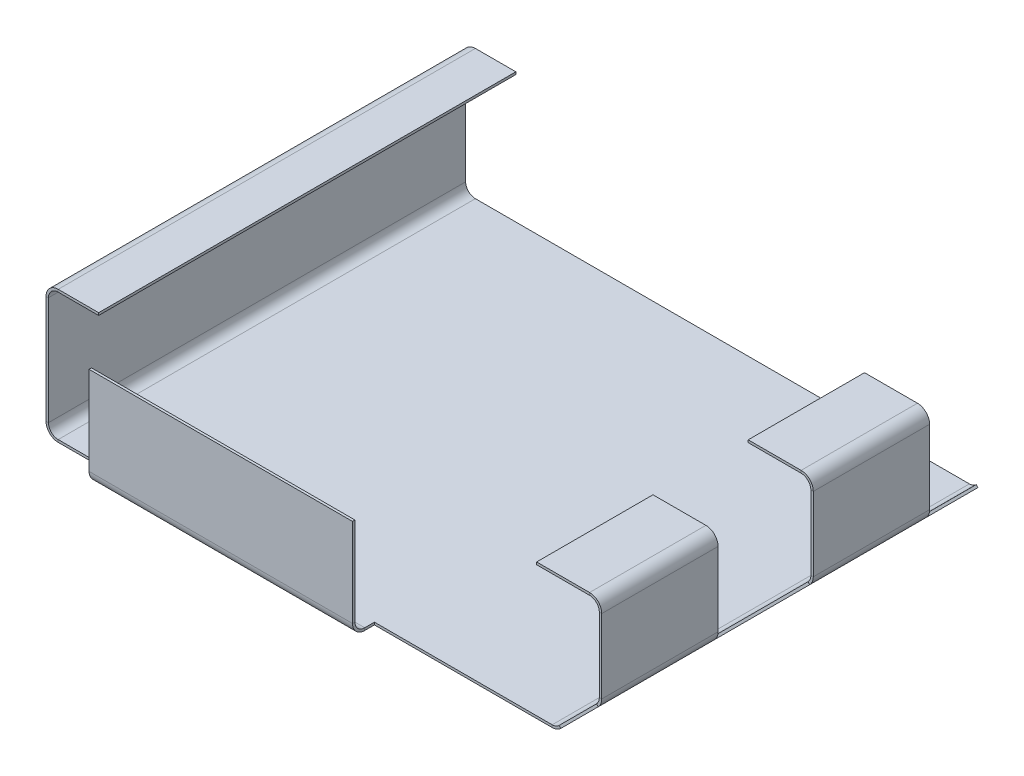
ISO-10303-21;
HEADER;
FILE_DESCRIPTION(('STEP AP214'),'2;1');
FILE_NAME('part.step','',(''),(''),'','','');
FILE_SCHEMA(('AUTOMOTIVE_DESIGN { 1 0 10303 214 1 1 1 1 }'));
ENDSEC;
DATA;
#1=APPLICATION_CONTEXT('core data for automotive mechanical design processes');
#2=APPLICATION_PROTOCOL_DEFINITION('international standard','automotive_design',2000,#1);
#3=PRODUCT_CONTEXT('',#1,'mechanical');
#4=PRODUCT('Part','Part','',(#3));
#5=PRODUCT_RELATED_PRODUCT_CATEGORY('part','',(#4));
#6=PRODUCT_DEFINITION_FORMATION('','',#4);
#7=PRODUCT_DEFINITION_CONTEXT('part definition',#1,'design');
#8=PRODUCT_DEFINITION('design','',#6,#7);
#9=PRODUCT_DEFINITION_SHAPE('','',#8);
#10=(LENGTH_UNIT() NAMED_UNIT(*) SI_UNIT(.MILLI.,.METRE.));
#11=(NAMED_UNIT(*) PLANE_ANGLE_UNIT() SI_UNIT($,.RADIAN.));
#12=(NAMED_UNIT(*) SI_UNIT($,.STERADIAN.) SOLID_ANGLE_UNIT());
#13=UNCERTAINTY_MEASURE_WITH_UNIT(LENGTH_MEASURE(1.E-05),#10,'distance_accuracy_value','');
#14=(GEOMETRIC_REPRESENTATION_CONTEXT(3) GLOBAL_UNCERTAINTY_ASSIGNED_CONTEXT((#13)) GLOBAL_UNIT_ASSIGNED_CONTEXT((#10,
#11,#12)) REPRESENTATION_CONTEXT('',''));
#15=CARTESIAN_POINT('',(0.,0.,0.));
#16=DIRECTION('',(0.,0.,1.));
#17=DIRECTION('',(1.,0.,0.));
#18=AXIS2_PLACEMENT_3D('',#15,#16,#17);
#19=CARTESIAN_POINT('',(36.1615216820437,0.5,41.3302543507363));
#20=DIRECTION('',(-1.,0.,0.));
#21=DIRECTION('',(0.,0.,1.));
#22=AXIS2_PLACEMENT_3D('',#19,#20,#21);
#23=PLANE('',#22);
#24=DIRECTION('',(0.,0.,-1.));
#25=VECTOR('',#24,1.);
#26=CARTESIAN_POINT('',(36.1615216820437,0.5,41.3302543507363));
#27=LINE('',#26,#25);
#28=CARTESIAN_POINT('',(36.1615216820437,0.499999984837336,43.3223260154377));
#29=VERTEX_POINT('',#28);
#30=CARTESIAN_POINT('',(36.1615216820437,0.5,41.3302543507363));
#31=VERTEX_POINT('',#30);
#32=EDGE_CURVE('E37',#29,#31,#27,.T.);
#33=ORIENTED_EDGE('',*,*,#32,.F.);
#34=DIRECTION('',(0.,-1.,0.));
#35=VECTOR('',#34,1.);
#36=CARTESIAN_POINT('',(36.1615216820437,0.5,43.3223260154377));
#37=LINE('',#36,#35);
#38=CARTESIAN_POINT('',(36.1615216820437,0.,43.3223260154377));
#39=VERTEX_POINT('',#38);
#40=EDGE_CURVE('E11',#29,#39,#37,.T.);
#41=ORIENTED_EDGE('',*,*,#40,.T.);
#42=DIRECTION('',(0.,0.,-1.));
#43=VECTOR('',#42,1.);
#44=CARTESIAN_POINT('',(36.1615216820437,0.,41.3302543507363));
#45=LINE('',#44,#43);
#46=CARTESIAN_POINT('',(36.1615216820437,0.,41.3302543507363));
#47=VERTEX_POINT('',#46);
#48=EDGE_CURVE('E615',#39,#47,#45,.T.);
#49=ORIENTED_EDGE('',*,*,#48,.T.);
#50=DIRECTION('',(0.,-1.,0.));
#51=VECTOR('',#50,1.);
#52=CARTESIAN_POINT('',(36.1615216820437,0.5,41.3302543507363));
#53=LINE('',#52,#51);
#54=EDGE_CURVE('E592',#31,#47,#53,.T.);
#55=ORIENTED_EDGE('',*,*,#54,.F.);
#56=EDGE_LOOP('',(#33,#41,#49,#55));
#57=FACE_BOUND('',#56,.T.);
#58=ADVANCED_FACE('F34',(#57),#23,.F.);
#59=CARTESIAN_POINT('',(-17.926574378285,0.5,41.3302543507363));
#60=DIRECTION('',(1.,0.,0.));
#61=DIRECTION('',(0.,0.,-1.));
#62=AXIS2_PLACEMENT_3D('',#59,#60,#61);
#63=PLANE('',#62);
#64=DIRECTION('',(0.,0.,1.));
#65=VECTOR('',#64,1.);
#66=CARTESIAN_POINT('',(-17.926574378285,0.,41.3302543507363));
#67=LINE('',#66,#65);
#68=CARTESIAN_POINT('',(-17.926574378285,0.,41.3302543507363));
#69=VERTEX_POINT('',#68);
#70=CARTESIAN_POINT('',(-17.926574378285,-3.03253268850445E-08,43.3223260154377));
#71=VERTEX_POINT('',#70);
#72=EDGE_CURVE('E630',#69,#71,#67,.T.);
#73=ORIENTED_EDGE('',*,*,#72,.T.);
#74=DIRECTION('',(0.,1.,0.));
#75=VECTOR('',#74,1.);
#76=CARTESIAN_POINT('',(-17.926574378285,0.5,43.3223260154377));
#77=LINE('',#76,#75);
#78=CARTESIAN_POINT('',(-17.926574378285,0.499999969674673,43.3223260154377));
#79=VERTEX_POINT('',#78);
#80=EDGE_CURVE('E696',#71,#79,#77,.T.);
#81=ORIENTED_EDGE('',*,*,#80,.T.);
#82=DIRECTION('',(0.,0.,1.));
#83=VECTOR('',#82,1.);
#84=CARTESIAN_POINT('',(-17.926574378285,0.5,41.3302543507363));
#85=LINE('',#84,#83);
#86=CARTESIAN_POINT('',(-17.926574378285,0.5,41.3302543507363));
#87=VERTEX_POINT('',#86);
#88=EDGE_CURVE('E637',#87,#79,#85,.T.);
#89=ORIENTED_EDGE('',*,*,#88,.F.);
#90=DIRECTION('',(0.,-1.,0.));
#91=VECTOR('',#90,1.);
#92=CARTESIAN_POINT('',(-17.926574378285,0.5,41.3302543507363));
#93=LINE('',#92,#91);
#94=EDGE_CURVE('E595',#87,#69,#93,.T.);
#95=ORIENTED_EDGE('',*,*,#94,.T.);
#96=EDGE_LOOP('',(#73,#81,#89,#95));
#97=FACE_BOUND('',#96,.T.);
#98=ADVANCED_FACE('F782',(#97),#63,.F.);
#99=CARTESIAN_POINT('',(-67.1382864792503,0.,41.3302543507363));
#100=DIRECTION('',(0.,1.,0.));
#101=DIRECTION('',(0.,0.,1.));
#102=AXIS2_PLACEMENT_3D('',#99,#100,#101);
#103=PLANE('',#102);
#104=ORIENTED_EDGE('',*,*,#48,.F.);
#105=DIRECTION('',(-1.,0.,0.));
#106=VECTOR('',#105,1.);
#107=CARTESIAN_POINT('',(-67.1382864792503,0.,43.3223260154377));
#108=LINE('',#107,#106);
#109=EDGE_CURVE('E42',#39,#71,#108,.T.);
#110=ORIENTED_EDGE('',*,*,#109,.T.);
#111=ORIENTED_EDGE('',*,*,#72,.F.);
#112=DIRECTION('',(1.,0.,0.));
#113=VECTOR('',#112,1.);
#114=CARTESIAN_POINT('',(-67.1382864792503,0.,41.3302543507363));
#115=LINE('',#114,#113);
#116=CARTESIAN_POINT('',(-28.7634186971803,0.,41.3302543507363));
#117=VERTEX_POINT('',#116);
#118=EDGE_CURVE('E590',#117,#69,#115,.T.);
#119=ORIENTED_EDGE('',*,*,#118,.F.);
#120=DIRECTION('',(0.,0.,-1.));
#121=VECTOR('',#120,1.);
#122=CARTESIAN_POINT('',(-28.7634186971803,0.,41.3302543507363));
#123=LINE('',#122,#121);
#124=CARTESIAN_POINT('',(-28.7634186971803,-2.01341924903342E-08,-44.3224899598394));
#125=VERTEX_POINT('',#124);
#126=EDGE_CURVE('E622',#117,#125,#123,.T.);
#127=ORIENTED_EDGE('',*,*,#126,.T.);
#128=DIRECTION('',(-1.,0.,0.));
#129=VECTOR('',#128,1.);
#130=CARTESIAN_POINT('',(-67.1382864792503,0.,-44.3224899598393));
#131=LINE('',#130,#129);
#132=CARTESIAN_POINT('',(72.6553800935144,0.,-44.3224899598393));
#133=VERTEX_POINT('',#132);
#134=EDGE_CURVE('E614',#133,#125,#131,.T.);
#135=ORIENTED_EDGE('',*,*,#134,.F.);
#136=DIRECTION('',(0.,0.,-1.));
#137=VECTOR('',#136,1.);
#138=CARTESIAN_POINT('',(72.6553800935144,0.,41.3302543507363));
#139=LINE('',#138,#137);
#140=CARTESIAN_POINT('',(72.6553800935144,0.,41.3302543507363));
#141=VERTEX_POINT('',#140);
#142=EDGE_CURVE('E605',#141,#133,#139,.T.);
#143=ORIENTED_EDGE('',*,*,#142,.F.);
#144=DIRECTION('',(1.,0.,0.));
#145=VECTOR('',#144,1.);
#146=CARTESIAN_POINT('',(36.1615216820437,0.,41.3302543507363));
#147=LINE('',#146,#145);
#148=EDGE_CURVE('E612',#47,#141,#147,.T.);
#149=ORIENTED_EDGE('',*,*,#148,.F.);
#150=EDGE_LOOP('',(#104,#110,#111,#119,#127,#135,#143,#149));
#151=FACE_BOUND('',#150,.T.);
#152=ADVANCED_FACE('F822',(#151),#103,.F.);
#153=CARTESIAN_POINT('',(-67.1382864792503,0.5,-44.3224899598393));
#154=DIRECTION('',(0.,0.,1.));
#155=DIRECTION('',(1.,0.,0.));
#156=AXIS2_PLACEMENT_3D('',#153,#154,#155);
#157=PLANE('',#156);
#158=ORIENTED_EDGE('',*,*,#134,.T.);
#159=DIRECTION('',(0.,1.,0.));
#160=VECTOR('',#159,1.);
#161=CARTESIAN_POINT('',(-28.7634186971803,0.5,-44.3224899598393));
#162=LINE('',#161,#160);
#163=CARTESIAN_POINT('',(-28.7634186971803,0.499999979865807,-44.3224899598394));
#164=VERTEX_POINT('',#163);
#165=EDGE_CURVE('E619',#125,#164,#162,.T.);
#166=ORIENTED_EDGE('',*,*,#165,.T.);
#167=DIRECTION('',(-1.,0.,0.));
#168=VECTOR('',#167,1.);
#169=CARTESIAN_POINT('',(-67.1382864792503,0.5,-44.3224899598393));
#170=LINE('',#169,#168);
#171=CARTESIAN_POINT('',(72.6553800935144,0.499999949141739,-44.3224899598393));
#172=VERTEX_POINT('',#171);
#173=EDGE_CURVE('E596',#172,#164,#170,.T.);
#174=ORIENTED_EDGE('',*,*,#173,.F.);
#175=DIRECTION('',(0.,1.,0.));
#176=VECTOR('',#175,1.);
#177=CARTESIAN_POINT('',(72.6553800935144,0.5,-44.3224899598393));
#178=LINE('',#177,#176);
#179=EDGE_CURVE('E608',#133,#172,#178,.T.);
#180=ORIENTED_EDGE('',*,*,#179,.F.);
#181=EDGE_LOOP('',(#158,#166,#174,#180));
#182=FACE_BOUND('',#181,.T.);
#183=ADVANCED_FACE('F771',(#182),#157,.F.);
#184=CARTESIAN_POINT('',(-67.1382864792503,0.5,41.3302543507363));
#185=DIRECTION('',(0.,0.,-1.));
#186=DIRECTION('',(-1.,0.,0.));
#187=AXIS2_PLACEMENT_3D('',#184,#185,#186);
#188=PLANE('',#187);
#189=DIRECTION('',(1.,0.,0.));
#190=VECTOR('',#189,1.);
#191=CARTESIAN_POINT('',(-67.1382864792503,0.5,41.3302543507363));
#192=LINE('',#191,#190);
#193=CARTESIAN_POINT('',(-28.7634186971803,0.499999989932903,41.3302543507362));
#194=VERTEX_POINT('',#193);
#195=EDGE_CURVE('E633',#194,#87,#192,.T.);
#196=ORIENTED_EDGE('',*,*,#195,.F.);
#197=DIRECTION('',(0.,-1.,0.));
#198=VECTOR('',#197,1.);
#199=CARTESIAN_POINT('',(-28.7634186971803,0.5,41.3302543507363));
#200=LINE('',#199,#198);
#201=EDGE_CURVE('E625',#194,#117,#200,.T.);
#202=ORIENTED_EDGE('',*,*,#201,.T.);
#203=ORIENTED_EDGE('',*,*,#118,.T.);
#204=ORIENTED_EDGE('',*,*,#94,.F.);
#205=EDGE_LOOP('',(#196,#202,#203,#204));
#206=FACE_BOUND('',#205,.T.);
#207=ADVANCED_FACE('F778',(#206),#188,.F.);
#208=CARTESIAN_POINT('',(-67.1382864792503,0.5,41.3302543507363));
#209=DIRECTION('',(0.,1.,0.));
#210=DIRECTION('',(0.,0.,1.));
#211=AXIS2_PLACEMENT_3D('',#208,#209,#210);
#212=PLANE('',#211);
#213=DIRECTION('',(-1.,0.,0.));
#214=VECTOR('',#213,1.);
#215=CARTESIAN_POINT('',(-67.1382864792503,0.5,43.3223260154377));
#216=LINE('',#215,#214);
#217=EDGE_CURVE('E678',#29,#79,#216,.T.);
#218=ORIENTED_EDGE('',*,*,#217,.F.);
#219=ORIENTED_EDGE('',*,*,#32,.T.);
#220=DIRECTION('',(1.,0.,0.));
#221=VECTOR('',#220,1.);
#222=CARTESIAN_POINT('',(36.1615216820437,0.5,41.3302543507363));
#223=LINE('',#222,#221);
#224=CARTESIAN_POINT('',(72.6553800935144,0.5,41.3302543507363));
#225=VERTEX_POINT('',#224);
#226=EDGE_CURVE('E616',#31,#225,#223,.T.);
#227=ORIENTED_EDGE('',*,*,#226,.T.);
#228=DIRECTION('',(0.,0.,-1.));
#229=VECTOR('',#228,1.);
#230=CARTESIAN_POINT('',(72.6553800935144,0.5,41.3302543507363));
#231=LINE('',#230,#229);
#232=EDGE_CURVE('E599',#225,#172,#231,.T.);
#233=ORIENTED_EDGE('',*,*,#232,.T.);
#234=ORIENTED_EDGE('',*,*,#173,.T.);
#235=DIRECTION('',(0.,0.,-1.));
#236=VECTOR('',#235,1.);
#237=CARTESIAN_POINT('',(-28.7634186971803,0.5,41.3302543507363));
#238=LINE('',#237,#236);
#239=EDGE_CURVE('E611',#194,#164,#238,.T.);
#240=ORIENTED_EDGE('',*,*,#239,.F.);
#241=ORIENTED_EDGE('',*,*,#195,.T.);
#242=ORIENTED_EDGE('',*,*,#88,.T.);
#243=EDGE_LOOP('',(#218,#219,#227,#233,#234,#240,#241,#242));
#244=FACE_BOUND('',#243,.T.);
#245=ADVANCED_FACE('F709',(#244),#212,.T.);
#246=CARTESIAN_POINT('',(36.1615216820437,0.5,41.3302543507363));
#247=DIRECTION('',(0.,0.,-1.));
#248=DIRECTION('',(-1.,0.,0.));
#249=AXIS2_PLACEMENT_3D('',#246,#247,#248);
#250=PLANE('',#249);
#251=DIRECTION('',(0.,-1.,0.));
#252=VECTOR('',#251,1.);
#253=CARTESIAN_POINT('',(72.6553800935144,0.5,41.3302543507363));
#254=LINE('',#253,#252);
#255=EDGE_CURVE('E602',#225,#141,#254,.T.);
#256=ORIENTED_EDGE('',*,*,#255,.F.);
#257=ORIENTED_EDGE('',*,*,#226,.F.);
#258=ORIENTED_EDGE('',*,*,#54,.T.);
#259=ORIENTED_EDGE('',*,*,#148,.T.);
#260=EDGE_LOOP('',(#256,#257,#258,#259));
#261=FACE_BOUND('',#260,.T.);
#262=ADVANCED_FACE('F716',(#261),#250,.F.);
#263=CARTESIAN_POINT('',(72.6553800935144,2.50000005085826,41.3302543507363));
#264=DIRECTION('',(0.,0.,-1.));
#265=DIRECTION('',(-1.,0.,0.));
#266=AXIS2_PLACEMENT_3D('',#263,#264,#265);
#267=PLANE('',#266);
#268=ORIENTED_EDGE('',*,*,#255,.T.);
#269=CARTESIAN_POINT('',(72.6553800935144,2.5,41.3302543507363));
#270=DIRECTION('',(0.,0.,-1.));
#271=DIRECTION('',(-1.,0.,0.));
#272=AXIS2_PLACEMENT_3D('',#269,#270,#271);
#273=CIRCLE('',#272,2.50000005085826);
#274=CARTESIAN_POINT('',(74.423147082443,0.732233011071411,41.3302543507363));
#275=VERTEX_POINT('',#274);
#276=EDGE_CURVE('E514',#141,#275,#273,.F.);
#277=ORIENTED_EDGE('',*,*,#276,.T.);
#278=DIRECTION('',(-0.707106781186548,0.707106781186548,0.));
#279=VECTOR('',#278,1.);
#280=CARTESIAN_POINT('',(74.0695936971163,1.08578639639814,41.3302543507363));
#281=LINE('',#280,#279);
#282=CARTESIAN_POINT('',(74.0695936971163,1.08578639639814,41.3302543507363));
#283=VERTEX_POINT('',#282);
#284=EDGE_CURVE('E588',#275,#283,#281,.T.);
#285=ORIENTED_EDGE('',*,*,#284,.T.);
#286=CARTESIAN_POINT('',(72.6553800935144,2.50000005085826,41.3302543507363));
#287=DIRECTION('',(0.,0.,1.));
#288=DIRECTION('',(1.,0.,0.));
#289=AXIS2_PLACEMENT_3D('',#286,#287,#288);
#290=CIRCLE('',#289,2.0000000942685);
#291=EDGE_CURVE('E552',#225,#283,#290,.T.);
#292=ORIENTED_EDGE('',*,*,#291,.F.);
#293=EDGE_LOOP('',(#268,#277,#285,#292));
#294=FACE_BOUND('',#293,.T.);
#295=ADVANCED_FACE('F726',(#294),#267,.F.);
#296=CARTESIAN_POINT('',(74.0695936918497,1.08578640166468,37.49263020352));
#297=DIRECTION('',(-0.70710678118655,-0.707106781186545,0.));
#298=DIRECTION('',(0.,0.,-1.));
#299=AXIS2_PLACEMENT_3D('',#296,#297,#298);
#300=PLANE('',#299);
#301=ORIENTED_EDGE('',*,*,#284,.F.);
#302=DIRECTION('',(0.,0.,-1.));
#303=VECTOR('',#302,1.);
#304=CARTESIAN_POINT('',(74.423147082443,0.732233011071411,84.2480590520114));
#305=LINE('',#304,#303);
#306=CARTESIAN_POINT('',(74.423147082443,0.732233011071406,33.6550060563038));
#307=VERTEX_POINT('',#306);
#308=EDGE_CURVE('E545',#275,#307,#305,.T.);
#309=ORIENTED_EDGE('',*,*,#308,.T.);
#310=DIRECTION('',(-0.707106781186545,0.70710678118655,0.));
#311=VECTOR('',#310,1.);
#312=CARTESIAN_POINT('',(74.0695936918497,1.08578640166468,33.6550060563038));
#313=LINE('',#312,#311);
#314=CARTESIAN_POINT('',(74.0695936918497,1.08578640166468,33.6550060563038));
#315=VERTEX_POINT('',#314);
#316=EDGE_CURVE('E586',#307,#315,#313,.T.);
#317=ORIENTED_EDGE('',*,*,#316,.T.);
#318=DIRECTION('',(0.,0.,-1.));
#319=VECTOR('',#318,1.);
#320=CARTESIAN_POINT('',(74.0695936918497,1.08578640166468,41.3302543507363));
#321=LINE('',#320,#319);
#322=EDGE_CURVE('E555',#283,#315,#321,.T.);
#323=ORIENTED_EDGE('',*,*,#322,.F.);
#324=EDGE_LOOP('',(#301,#309,#317,#323));
#325=FACE_BOUND('',#324,.T.);
#326=ADVANCED_FACE('F729',(#325),#300,.F.);
#327=CARTESIAN_POINT('',(72.6553800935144,2.50000005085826,33.6550060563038));
#328=DIRECTION('',(0.,0.,-1.));
#329=DIRECTION('',(-1.,0.,0.));
#330=AXIS2_PLACEMENT_3D('',#327,#328,#329);
#331=PLANE('',#330);
#332=ORIENTED_EDGE('',*,*,#316,.F.);
#333=CARTESIAN_POINT('',(72.6553800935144,2.5,33.6550060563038));
#334=DIRECTION('',(0.,0.,-1.));
#335=DIRECTION('',(-1.,0.,0.));
#336=AXIS2_PLACEMENT_3D('',#333,#334,#335);
#337=CIRCLE('',#336,2.50000005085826);
#338=CARTESIAN_POINT('',(75.1553800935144,2.5,33.6550060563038));
#339=VERTEX_POINT('',#338);
#340=EDGE_CURVE('E542',#307,#339,#337,.F.);
#341=ORIENTED_EDGE('',*,*,#340,.T.);
#342=DIRECTION('',(1.,0.,0.));
#343=VECTOR('',#342,1.);
#344=CARTESIAN_POINT('',(74.6553800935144,2.5,33.6550060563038));
#345=LINE('',#344,#343);
#346=CARTESIAN_POINT('',(74.6553800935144,2.5,33.6550060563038));
#347=VERTEX_POINT('',#346);
#348=EDGE_CURVE('E519',#347,#339,#345,.T.);
#349=ORIENTED_EDGE('',*,*,#348,.F.);
#350=CARTESIAN_POINT('',(72.6553800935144,2.50000005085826,33.6550060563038));
#351=DIRECTION('',(0.,0.,1.));
#352=DIRECTION('',(1.,0.,0.));
#353=AXIS2_PLACEMENT_3D('',#350,#351,#352);
#354=CIRCLE('',#353,2.00000006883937);
#355=EDGE_CURVE('E558',#315,#347,#354,.T.);
#356=ORIENTED_EDGE('',*,*,#355,.F.);
#357=EDGE_LOOP('',(#332,#341,#349,#356));
#358=FACE_BOUND('',#357,.T.);
#359=ADVANCED_FACE('F738',(#358),#331,.F.);
#360=CARTESIAN_POINT('',(72.6553800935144,2.50000005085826,9.77424255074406));
#361=DIRECTION('',(0.,0.,1.));
#362=DIRECTION('',(1.,0.,0.));
#363=AXIS2_PLACEMENT_3D('',#360,#361,#362);
#364=PLANE('',#363);
#365=DIRECTION('',(-1.,0.,0.));
#366=VECTOR('',#365,1.);
#367=CARTESIAN_POINT('',(74.6553800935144,2.5,9.77424255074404));
#368=LINE('',#367,#366);
#369=CARTESIAN_POINT('',(75.1553800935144,2.5,9.77424255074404));
#370=VERTEX_POINT('',#369);
#371=CARTESIAN_POINT('',(74.6553801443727,2.5,9.77424255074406));
#372=VERTEX_POINT('',#371);
#373=EDGE_CURVE('E512',#370,#372,#368,.T.);
#374=ORIENTED_EDGE('',*,*,#373,.F.);
#375=CARTESIAN_POINT('',(72.6553800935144,2.5,9.77424255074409));
#376=DIRECTION('',(0.,0.,-1.));
#377=DIRECTION('',(-1.,0.,0.));
#378=AXIS2_PLACEMENT_3D('',#375,#376,#377);
#379=CIRCLE('',#378,2.50000005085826);
#380=CARTESIAN_POINT('',(74.423147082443,0.732233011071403,9.77424255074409));
#381=VERTEX_POINT('',#380);
#382=EDGE_CURVE('E539',#370,#381,#379,.T.);
#383=ORIENTED_EDGE('',*,*,#382,.T.);
#384=DIRECTION('',(-0.707106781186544,0.707106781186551,0.));
#385=VECTOR('',#384,1.);
#386=CARTESIAN_POINT('',(74.0695936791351,1.08578641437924,9.77424255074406));
#387=LINE('',#386,#385);
#388=CARTESIAN_POINT('',(74.0695936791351,1.08578641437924,9.77424255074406));
#389=VERTEX_POINT('',#388);
#390=EDGE_CURVE('E584',#381,#389,#387,.T.);
#391=ORIENTED_EDGE('',*,*,#390,.T.);
#392=CARTESIAN_POINT('',(72.6553800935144,2.50000005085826,9.77424255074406));
#393=DIRECTION('',(0.,0.,-1.));
#394=DIRECTION('',(-1.,0.,0.));
#395=AXIS2_PLACEMENT_3D('',#392,#393,#394);
#396=CIRCLE('',#395,2.00000006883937);
#397=EDGE_CURVE('E561',#372,#389,#396,.T.);
#398=ORIENTED_EDGE('',*,*,#397,.F.);
#399=EDGE_LOOP('',(#374,#383,#391,#398));
#400=FACE_BOUND('',#399,.T.);
#401=ADVANCED_FACE('F746',(#400),#364,.F.);
#402=CARTESIAN_POINT('',(74.0695936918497,1.08578640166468,0.));
#403=DIRECTION('',(-0.70710678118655,-0.707106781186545,0.));
#404=DIRECTION('',(0.,0.,-1.));
#405=AXIS2_PLACEMENT_3D('',#402,#403,#404);
#406=PLANE('',#405);
#407=ORIENTED_EDGE('',*,*,#390,.F.);
#408=DIRECTION('',(0.,0.,-1.));
#409=VECTOR('',#408,1.);
#410=CARTESIAN_POINT('',(74.423147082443,0.732233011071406,84.2480590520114));
#411=LINE('',#410,#409);
#412=CARTESIAN_POINT('',(74.423147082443,0.732233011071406,-9.77424255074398));
#413=VERTEX_POINT('',#412);
#414=EDGE_CURVE('E536',#381,#413,#411,.T.);
#415=ORIENTED_EDGE('',*,*,#414,.T.);
#416=DIRECTION('',(-0.707106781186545,0.70710678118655,0.));
#417=VECTOR('',#416,1.);
#418=CARTESIAN_POINT('',(74.0695936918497,1.08578640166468,-9.77424255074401));
#419=LINE('',#418,#417);
#420=CARTESIAN_POINT('',(74.0695936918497,1.08578640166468,-9.77424255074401));
#421=VERTEX_POINT('',#420);
#422=EDGE_CURVE('E582',#413,#421,#419,.T.);
#423=ORIENTED_EDGE('',*,*,#422,.T.);
#424=DIRECTION('',(0.,0.,-1.));
#425=VECTOR('',#424,1.);
#426=CARTESIAN_POINT('',(74.0695936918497,1.08578640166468,9.77424255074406));
#427=LINE('',#426,#425);
#428=EDGE_CURVE('E564',#389,#421,#427,.T.);
#429=ORIENTED_EDGE('',*,*,#428,.F.);
#430=EDGE_LOOP('',(#407,#415,#423,#429));
#431=FACE_BOUND('',#430,.T.);
#432=ADVANCED_FACE('F749',(#431),#406,.F.);
#433=CARTESIAN_POINT('',(72.6553800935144,2.50000005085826,-9.77424255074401));
#434=DIRECTION('',(0.,0.,-1.));
#435=DIRECTION('',(-1.,0.,0.));
#436=AXIS2_PLACEMENT_3D('',#433,#434,#435);
#437=PLANE('',#436);
#438=ORIENTED_EDGE('',*,*,#422,.F.);
#439=CARTESIAN_POINT('',(72.6553800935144,2.5,-9.77424255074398));
#440=DIRECTION('',(0.,0.,-1.));
#441=DIRECTION('',(-1.,0.,0.));
#442=AXIS2_PLACEMENT_3D('',#439,#440,#441);
#443=CIRCLE('',#442,2.50000005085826);
#444=CARTESIAN_POINT('',(75.1553800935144,2.5,-9.77424255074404));
#445=VERTEX_POINT('',#444);
#446=EDGE_CURVE('E533',#413,#445,#443,.F.);
#447=ORIENTED_EDGE('',*,*,#446,.T.);
#448=DIRECTION('',(1.,0.,0.));
#449=VECTOR('',#448,1.);
#450=CARTESIAN_POINT('',(74.6553800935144,2.5,-9.77424255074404));
#451=LINE('',#450,#449);
#452=CARTESIAN_POINT('',(74.6553800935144,2.5,-9.77424255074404));
#453=VERTEX_POINT('',#452);
#454=EDGE_CURVE('E505',#453,#445,#451,.T.);
#455=ORIENTED_EDGE('',*,*,#454,.F.);
#456=CARTESIAN_POINT('',(72.6553800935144,2.50000005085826,-9.77424255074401));
#457=DIRECTION('',(0.,0.,1.));
#458=DIRECTION('',(1.,0.,0.));
#459=AXIS2_PLACEMENT_3D('',#456,#457,#458);
#460=CIRCLE('',#459,2.00000006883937);
#461=EDGE_CURVE('E567',#421,#453,#460,.T.);
#462=ORIENTED_EDGE('',*,*,#461,.F.);
#463=EDGE_LOOP('',(#438,#447,#455,#462));
#464=FACE_BOUND('',#463,.T.);
#465=ADVANCED_FACE('F755',(#464),#437,.F.);
#466=CARTESIAN_POINT('',(72.6553800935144,2.50000005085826,-33.6550060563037));
#467=DIRECTION('',(0.,0.,1.));
#468=DIRECTION('',(1.,0.,0.));
#469=AXIS2_PLACEMENT_3D('',#466,#467,#468);
#470=PLANE('',#469);
#471=DIRECTION('',(-1.,0.,0.));
#472=VECTOR('',#471,1.);
#473=CARTESIAN_POINT('',(74.6553800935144,2.5,-33.6550060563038));
#474=LINE('',#473,#472);
#475=CARTESIAN_POINT('',(75.1553800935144,2.5,-33.6550060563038));
#476=VERTEX_POINT('',#475);
#477=CARTESIAN_POINT('',(74.6553801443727,2.5,-33.6550060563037));
#478=VERTEX_POINT('',#477);
#479=EDGE_CURVE('E498',#476,#478,#474,.T.);
#480=ORIENTED_EDGE('',*,*,#479,.F.);
#481=CARTESIAN_POINT('',(72.6553800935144,2.5,-33.6550060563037));
#482=DIRECTION('',(0.,0.,-1.));
#483=DIRECTION('',(-1.,0.,0.));
#484=AXIS2_PLACEMENT_3D('',#481,#482,#483);
#485=CIRCLE('',#484,2.50000005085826);
#486=CARTESIAN_POINT('',(74.423147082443,0.732233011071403,-33.6550060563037));
#487=VERTEX_POINT('',#486);
#488=EDGE_CURVE('E530',#476,#487,#485,.T.);
#489=ORIENTED_EDGE('',*,*,#488,.T.);
#490=DIRECTION('',(-0.707106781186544,0.707106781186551,0.));
#491=VECTOR('',#490,1.);
#492=CARTESIAN_POINT('',(74.0695936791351,1.08578641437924,-33.6550060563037));
#493=LINE('',#492,#491);
#494=CARTESIAN_POINT('',(74.0695936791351,1.08578641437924,-33.6550060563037));
#495=VERTEX_POINT('',#494);
#496=EDGE_CURVE('E580',#487,#495,#493,.T.);
#497=ORIENTED_EDGE('',*,*,#496,.T.);
#498=CARTESIAN_POINT('',(72.6553800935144,2.50000005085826,-33.6550060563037));
#499=DIRECTION('',(0.,0.,-1.));
#500=DIRECTION('',(-1.,0.,0.));
#501=AXIS2_PLACEMENT_3D('',#498,#499,#500);
#502=CIRCLE('',#501,2.00000006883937);
#503=EDGE_CURVE('E570',#478,#495,#502,.T.);
#504=ORIENTED_EDGE('',*,*,#503,.F.);
#505=EDGE_LOOP('',(#480,#489,#497,#504));
#506=FACE_BOUND('',#505,.T.);
#507=ADVANCED_FACE('F763',(#506),#470,.F.);
#508=CARTESIAN_POINT('',(74.0695936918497,1.08578640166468,-38.9887480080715));
#509=DIRECTION('',(-0.70710678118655,-0.707106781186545,0.));
#510=DIRECTION('',(0.,0.,-1.));
#511=AXIS2_PLACEMENT_3D('',#508,#509,#510);
#512=PLANE('',#511);
#513=ORIENTED_EDGE('',*,*,#496,.F.);
#514=DIRECTION('',(0.,0.,-1.));
#515=VECTOR('',#514,1.);
#516=CARTESIAN_POINT('',(74.423147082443,0.732233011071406,84.2480590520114));
#517=LINE('',#516,#515);
#518=CARTESIAN_POINT('',(74.423147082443,0.732233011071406,-44.3224899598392));
#519=VERTEX_POINT('',#518);
#520=EDGE_CURVE('E526',#487,#519,#517,.T.);
#521=ORIENTED_EDGE('',*,*,#520,.T.);
#522=DIRECTION('',(-0.707106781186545,0.70710678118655,0.));
#523=VECTOR('',#522,1.);
#524=CARTESIAN_POINT('',(74.0695936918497,1.08578640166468,-44.3224899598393));
#525=LINE('',#524,#523);
#526=CARTESIAN_POINT('',(74.0695936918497,1.08578640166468,-44.3224899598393));
#527=VERTEX_POINT('',#526);
#528=EDGE_CURVE('E579',#519,#527,#525,.T.);
#529=ORIENTED_EDGE('',*,*,#528,.T.);
#530=DIRECTION('',(0.,0.,-1.));
#531=VECTOR('',#530,1.);
#532=CARTESIAN_POINT('',(74.0695936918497,1.08578640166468,-33.6550060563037));
#533=LINE('',#532,#531);
#534=EDGE_CURVE('E573',#495,#527,#533,.T.);
#535=ORIENTED_EDGE('',*,*,#534,.F.);
#536=EDGE_LOOP('',(#513,#521,#529,#535));
#537=FACE_BOUND('',#536,.T.);
#538=ADVANCED_FACE('F765',(#537),#512,.F.);
#539=CARTESIAN_POINT('',(72.6553800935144,2.50000005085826,-44.3224899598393));
#540=DIRECTION('',(0.,0.,1.));
#541=DIRECTION('',(1.,0.,0.));
#542=AXIS2_PLACEMENT_3D('',#539,#540,#541);
#543=PLANE('',#542);
#544=CARTESIAN_POINT('',(72.6553800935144,2.5,-44.3224899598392));
#545=DIRECTION('',(0.,0.,-1.));
#546=DIRECTION('',(-1.,0.,0.));
#547=AXIS2_PLACEMENT_3D('',#544,#545,#546);
#548=CIRCLE('',#547,2.50000005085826);
#549=EDGE_CURVE('E529',#519,#133,#548,.T.);
#550=ORIENTED_EDGE('',*,*,#549,.T.);
#551=ORIENTED_EDGE('',*,*,#179,.T.);
#552=CARTESIAN_POINT('',(72.6553800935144,2.50000005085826,-44.3224899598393));
#553=DIRECTION('',(0.,0.,-1.));
#554=DIRECTION('',(-1.,0.,0.));
#555=AXIS2_PLACEMENT_3D('',#552,#553,#554);
#556=CIRCLE('',#555,2.0000000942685);
#557=EDGE_CURVE('E576',#527,#172,#556,.T.);
#558=ORIENTED_EDGE('',*,*,#557,.F.);
#559=ORIENTED_EDGE('',*,*,#528,.F.);
#560=EDGE_LOOP('',(#550,#551,#558,#559));
#561=FACE_BOUND('',#560,.T.);
#562=ADVANCED_FACE('F768',(#561),#543,.F.);
#563=CARTESIAN_POINT('',(72.6553800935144,2.5,84.2480590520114));
#564=DIRECTION('',(0.,0.,-1.));
#565=DIRECTION('',(-1.,0.,0.));
#566=AXIS2_PLACEMENT_3D('',#563,#564,#565);
#567=CYLINDRICAL_SURFACE('',#566,2.00000005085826);
#568=ORIENTED_EDGE('',*,*,#534,.T.);
#569=ORIENTED_EDGE('',*,*,#557,.T.);
#570=ORIENTED_EDGE('',*,*,#232,.F.);
#571=ORIENTED_EDGE('',*,*,#291,.T.);
#572=ORIENTED_EDGE('',*,*,#322,.T.);
#573=ORIENTED_EDGE('',*,*,#355,.T.);
#574=DIRECTION('',(0.,0.,-1.));
#575=VECTOR('',#574,1.);
#576=CARTESIAN_POINT('',(74.6553800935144,2.5,41.3302543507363));
#577=LINE('',#576,#575);
#578=EDGE_CURVE('E500',#347,#372,#577,.T.);
#579=ORIENTED_EDGE('',*,*,#578,.T.);
#580=ORIENTED_EDGE('',*,*,#397,.T.);
#581=ORIENTED_EDGE('',*,*,#428,.T.);
#582=ORIENTED_EDGE('',*,*,#461,.T.);
#583=DIRECTION('',(0.,0.,-1.));
#584=VECTOR('',#583,1.);
#585=CARTESIAN_POINT('',(74.6553800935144,2.5,41.3302543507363));
#586=LINE('',#585,#584);
#587=EDGE_CURVE('E497',#453,#478,#586,.T.);
#588=ORIENTED_EDGE('',*,*,#587,.T.);
#589=ORIENTED_EDGE('',*,*,#503,.T.);
#590=EDGE_LOOP('',(#568,#569,#570,#571,#572,#573,#579,#580,#581,#582,#588,#589));
#591=FACE_BOUND('',#590,.T.);
#592=ADVANCED_FACE('F723',(#591),#567,.F.);
#593=CARTESIAN_POINT('',(72.6553800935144,2.5,84.2480590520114));
#594=DIRECTION('',(0.,0.,-1.));
#595=DIRECTION('',(-1.,0.,0.));
#596=AXIS2_PLACEMENT_3D('',#593,#594,#595);
#597=CYLINDRICAL_SURFACE('',#596,2.50000005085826);
#598=ORIENTED_EDGE('',*,*,#520,.F.);
#599=ORIENTED_EDGE('',*,*,#488,.F.);
#600=DIRECTION('',(0.,0.,-1.));
#601=VECTOR('',#600,1.);
#602=CARTESIAN_POINT('',(75.1553800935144,2.5,41.3302543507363));
#603=LINE('',#602,#601);
#604=EDGE_CURVE('E502',#445,#476,#603,.T.);
#605=ORIENTED_EDGE('',*,*,#604,.F.);
#606=ORIENTED_EDGE('',*,*,#446,.F.);
#607=ORIENTED_EDGE('',*,*,#414,.F.);
#608=ORIENTED_EDGE('',*,*,#382,.F.);
#609=DIRECTION('',(0.,0.,-1.));
#610=VECTOR('',#609,1.);
#611=CARTESIAN_POINT('',(75.1553800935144,2.5,41.3302543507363));
#612=LINE('',#611,#610);
#613=EDGE_CURVE('E516',#339,#370,#612,.T.);
#614=ORIENTED_EDGE('',*,*,#613,.F.);
#615=ORIENTED_EDGE('',*,*,#340,.F.);
#616=ORIENTED_EDGE('',*,*,#308,.F.);
#617=ORIENTED_EDGE('',*,*,#276,.F.);
#618=ORIENTED_EDGE('',*,*,#142,.T.);
#619=ORIENTED_EDGE('',*,*,#549,.F.);
#620=EDGE_LOOP('',(#598,#599,#605,#606,#607,#608,#614,#615,#616,#617,#618,#619));
#621=FACE_BOUND('',#620,.T.);
#622=ADVANCED_FACE('F733',(#621),#597,.T.);
#623=CARTESIAN_POINT('',(74.6553800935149,-141.220657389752,41.3302543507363));
#624=DIRECTION('',(-1.,0.,0.));
#625=DIRECTION('',(0.,0.,1.));
#626=AXIS2_PLACEMENT_3D('',#623,#624,#625);
#627=PLANE('',#626);
#628=DIRECTION('',(0.,0.,1.));
#629=VECTOR('',#628,1.);
#630=CARTESIAN_POINT('',(74.6553800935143,17.6785999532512,41.3302543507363));
#631=LINE('',#630,#629);
#632=CARTESIAN_POINT('',(74.6553800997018,17.6785999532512,9.77424255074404));
#633=VERTEX_POINT('',#632);
#634=CARTESIAN_POINT('',(74.6553801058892,17.6785999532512,33.6550060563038));
#635=VERTEX_POINT('',#634);
#636=EDGE_CURVE('E667',#633,#635,#631,.T.);
#637=ORIENTED_EDGE('',*,*,#636,.F.);
#638=DIRECTION('',(0.,-1.,0.));
#639=VECTOR('',#638,1.);
#640=CARTESIAN_POINT('',(74.6553800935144,0.536504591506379,9.77424255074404));
#641=LINE('',#640,#639);
#642=EDGE_CURVE('E525',#633,#372,#641,.T.);
#643=ORIENTED_EDGE('',*,*,#642,.T.);
#644=ORIENTED_EDGE('',*,*,#578,.F.);
#645=DIRECTION('',(0.,1.,0.));
#646=VECTOR('',#645,1.);
#647=CARTESIAN_POINT('',(74.6553800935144,0.536504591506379,33.6550060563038));
#648=LINE('',#647,#646);
#649=EDGE_CURVE('E682',#347,#635,#648,.T.);
#650=ORIENTED_EDGE('',*,*,#649,.T.);
#651=EDGE_LOOP('',(#637,#643,#644,#650));
#652=FACE_BOUND('',#651,.T.);
#653=ADVANCED_FACE('F858',(#652),#627,.T.);
#654=CARTESIAN_POINT('',(74.6553800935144,0.536504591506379,33.6550060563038));
#655=DIRECTION('',(0.,0.,-1.));
#656=DIRECTION('',(0.,-1.,0.));
#657=AXIS2_PLACEMENT_3D('',#654,#655,#656);
#658=PLANE('',#657);
#659=DIRECTION('',(0.,1.,0.));
#660=VECTOR('',#659,1.);
#661=CARTESIAN_POINT('',(75.1553800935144,0.536504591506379,33.6550060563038));
#662=LINE('',#661,#660);
#663=CARTESIAN_POINT('',(75.1553801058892,17.6785999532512,33.6550060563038));
#664=VERTEX_POINT('',#663);
#665=EDGE_CURVE('E522',#339,#664,#662,.T.);
#666=ORIENTED_EDGE('',*,*,#665,.T.);
#667=DIRECTION('',(-1.,0.,0.));
#668=VECTOR('',#667,1.);
#669=CARTESIAN_POINT('',(74.6553800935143,17.6785999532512,33.6550060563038));
#670=LINE('',#669,#668);
#671=EDGE_CURVE('E669',#664,#635,#670,.T.);
#672=ORIENTED_EDGE('',*,*,#671,.T.);
#673=ORIENTED_EDGE('',*,*,#649,.F.);
#674=ORIENTED_EDGE('',*,*,#348,.T.);
#675=EDGE_LOOP('',(#666,#672,#673,#674));
#676=FACE_BOUND('',#675,.T.);
#677=ADVANCED_FACE('F854',(#676),#658,.F.);
#678=CARTESIAN_POINT('',(75.1553800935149,-141.220657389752,41.3302543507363));
#679=DIRECTION('',(-1.,0.,0.));
#680=DIRECTION('',(0.,0.,1.));
#681=AXIS2_PLACEMENT_3D('',#678,#679,#680);
#682=PLANE('',#681);
#683=DIRECTION('',(0.,-1.,0.));
#684=VECTOR('',#683,1.);
#685=CARTESIAN_POINT('',(75.1553800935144,0.536504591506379,9.77424255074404));
#686=LINE('',#685,#684);
#687=CARTESIAN_POINT('',(75.1553800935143,17.6785999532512,9.77424255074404));
#688=VERTEX_POINT('',#687);
#689=EDGE_CURVE('E515',#688,#370,#686,.T.);
#690=ORIENTED_EDGE('',*,*,#689,.F.);
#691=DIRECTION('',(0.,0.,1.));
#692=VECTOR('',#691,1.);
#693=CARTESIAN_POINT('',(75.1553800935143,17.6785999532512,41.3302543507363));
#694=LINE('',#693,#692);
#695=EDGE_CURVE('E672',#688,#664,#694,.T.);
#696=ORIENTED_EDGE('',*,*,#695,.T.);
#697=ORIENTED_EDGE('',*,*,#665,.F.);
#698=ORIENTED_EDGE('',*,*,#613,.T.);
#699=EDGE_LOOP('',(#690,#696,#697,#698));
#700=FACE_BOUND('',#699,.T.);
#701=ADVANCED_FACE('F850',(#700),#682,.F.);
#702=CARTESIAN_POINT('',(74.6553800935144,0.536504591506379,9.77424255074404));
#703=DIRECTION('',(0.,0.,1.));
#704=DIRECTION('',(0.,1.,0.));
#705=AXIS2_PLACEMENT_3D('',#702,#703,#704);
#706=PLANE('',#705);
#707=ORIENTED_EDGE('',*,*,#642,.F.);
#708=DIRECTION('',(1.,0.,0.));
#709=VECTOR('',#708,1.);
#710=CARTESIAN_POINT('',(74.6553800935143,17.6785999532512,9.77424255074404));
#711=LINE('',#710,#709);
#712=EDGE_CURVE('E675',#633,#688,#711,.T.);
#713=ORIENTED_EDGE('',*,*,#712,.T.);
#714=ORIENTED_EDGE('',*,*,#689,.T.);
#715=ORIENTED_EDGE('',*,*,#373,.T.);
#716=EDGE_LOOP('',(#707,#713,#714,#715));
#717=FACE_BOUND('',#716,.T.);
#718=ADVANCED_FACE('F847',(#717),#706,.F.);
#719=CARTESIAN_POINT('',(74.6553800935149,-141.220657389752,41.3302543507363));
#720=DIRECTION('',(-1.,0.,0.));
#721=DIRECTION('',(0.,0.,1.));
#722=AXIS2_PLACEMENT_3D('',#719,#720,#721);
#723=PLANE('',#722);
#724=DIRECTION('',(0.,0.,1.));
#725=VECTOR('',#724,1.);
#726=CARTESIAN_POINT('',(74.6553800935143,17.6785999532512,41.3302543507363));
#727=LINE('',#726,#725);
#728=CARTESIAN_POINT('',(74.6553800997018,17.6785999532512,-33.6550060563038));
#729=VERTEX_POINT('',#728);
#730=CARTESIAN_POINT('',(74.6553801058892,17.6785999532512,-9.77424255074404));
#731=VERTEX_POINT('',#730);
#732=EDGE_CURVE('E648',#729,#731,#727,.T.);
#733=ORIENTED_EDGE('',*,*,#732,.F.);
#734=DIRECTION('',(0.,-1.,0.));
#735=VECTOR('',#734,1.);
#736=CARTESIAN_POINT('',(74.6553800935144,0.536504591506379,-33.6550060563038));
#737=LINE('',#736,#735);
#738=EDGE_CURVE('E511',#729,#478,#737,.T.);
#739=ORIENTED_EDGE('',*,*,#738,.T.);
#740=ORIENTED_EDGE('',*,*,#587,.F.);
#741=DIRECTION('',(0.,1.,0.));
#742=VECTOR('',#741,1.);
#743=CARTESIAN_POINT('',(74.6553800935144,0.536504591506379,-9.77424255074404));
#744=LINE('',#743,#742);
#745=EDGE_CURVE('E690',#453,#731,#744,.T.);
#746=ORIENTED_EDGE('',*,*,#745,.T.);
#747=EDGE_LOOP('',(#733,#739,#740,#746));
#748=FACE_BOUND('',#747,.T.);
#749=ADVANCED_FACE('F843',(#748),#723,.T.);
#750=CARTESIAN_POINT('',(74.6553800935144,0.536504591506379,-9.77424255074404));
#751=DIRECTION('',(0.,0.,-1.));
#752=DIRECTION('',(0.,-1.,0.));
#753=AXIS2_PLACEMENT_3D('',#750,#751,#752);
#754=PLANE('',#753);
#755=DIRECTION('',(0.,1.,0.));
#756=VECTOR('',#755,1.);
#757=CARTESIAN_POINT('',(75.1553800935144,0.536504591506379,-9.77424255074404));
#758=LINE('',#757,#756);
#759=CARTESIAN_POINT('',(75.1553801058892,17.6785999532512,-9.77424255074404));
#760=VERTEX_POINT('',#759);
#761=EDGE_CURVE('E508',#445,#760,#758,.T.);
#762=ORIENTED_EDGE('',*,*,#761,.T.);
#763=DIRECTION('',(-1.,0.,0.));
#764=VECTOR('',#763,1.);
#765=CARTESIAN_POINT('',(74.6553800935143,17.6785999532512,-9.77424255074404));
#766=LINE('',#765,#764);
#767=EDGE_CURVE('E658',#760,#731,#766,.T.);
#768=ORIENTED_EDGE('',*,*,#767,.T.);
#769=ORIENTED_EDGE('',*,*,#745,.F.);
#770=ORIENTED_EDGE('',*,*,#454,.T.);
#771=EDGE_LOOP('',(#762,#768,#769,#770));
#772=FACE_BOUND('',#771,.T.);
#773=ADVANCED_FACE('F839',(#772),#754,.F.);
#774=CARTESIAN_POINT('',(75.1553800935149,-141.220657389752,41.3302543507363));
#775=DIRECTION('',(-1.,0.,0.));
#776=DIRECTION('',(0.,0.,1.));
#777=AXIS2_PLACEMENT_3D('',#774,#775,#776);
#778=PLANE('',#777);
#779=DIRECTION('',(0.,-1.,0.));
#780=VECTOR('',#779,1.);
#781=CARTESIAN_POINT('',(75.1553800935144,0.536504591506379,-33.6550060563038));
#782=LINE('',#781,#780);
#783=CARTESIAN_POINT('',(75.1553800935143,17.6785999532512,-33.6550060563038));
#784=VERTEX_POINT('',#783);
#785=EDGE_CURVE('E501',#784,#476,#782,.T.);
#786=ORIENTED_EDGE('',*,*,#785,.F.);
#787=DIRECTION('',(0.,0.,1.));
#788=VECTOR('',#787,1.);
#789=CARTESIAN_POINT('',(75.1553800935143,17.6785999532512,41.3302543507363));
#790=LINE('',#789,#788);
#791=EDGE_CURVE('E661',#784,#760,#790,.T.);
#792=ORIENTED_EDGE('',*,*,#791,.T.);
#793=ORIENTED_EDGE('',*,*,#761,.F.);
#794=ORIENTED_EDGE('',*,*,#604,.T.);
#795=EDGE_LOOP('',(#786,#792,#793,#794));
#796=FACE_BOUND('',#795,.T.);
#797=ADVANCED_FACE('F835',(#796),#778,.F.);
#798=CARTESIAN_POINT('',(74.6553800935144,0.536504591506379,-33.6550060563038));
#799=DIRECTION('',(0.,0.,1.));
#800=DIRECTION('',(0.,1.,0.));
#801=AXIS2_PLACEMENT_3D('',#798,#799,#800);
#802=PLANE('',#801);
#803=ORIENTED_EDGE('',*,*,#738,.F.);
#804=DIRECTION('',(1.,0.,0.));
#805=VECTOR('',#804,1.);
#806=CARTESIAN_POINT('',(74.6553800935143,17.6785999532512,-33.6550060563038));
#807=LINE('',#806,#805);
#808=EDGE_CURVE('E664',#729,#784,#807,.T.);
#809=ORIENTED_EDGE('',*,*,#808,.T.);
#810=ORIENTED_EDGE('',*,*,#785,.T.);
#811=ORIENTED_EDGE('',*,*,#479,.T.);
#812=EDGE_LOOP('',(#803,#809,#810,#811));
#813=FACE_BOUND('',#812,.T.);
#814=ADVANCED_FACE('F831',(#813),#802,.F.);
#815=CARTESIAN_POINT('',(-28.7634186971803,2.50000002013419,41.3302543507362));
#816=DIRECTION('',(0.,0.,-1.));
#817=DIRECTION('',(-1.,0.,0.));
#818=AXIS2_PLACEMENT_3D('',#815,#816,#817);
#819=PLANE('',#818);
#820=DIRECTION('',(-1.,0.,0.));
#821=VECTOR('',#820,1.);
#822=CARTESIAN_POINT('',(-30.7634186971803,2.49999999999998,41.3302543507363));
#823=LINE('',#822,#821);
#824=CARTESIAN_POINT('',(-30.7634187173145,2.50000000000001,41.3302543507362));
#825=VERTEX_POINT('',#824);
#826=CARTESIAN_POINT('',(-31.2634186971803,2.5,41.3302543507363));
#827=VERTEX_POINT('',#826);
#828=EDGE_CURVE('E472',#825,#827,#823,.T.);
#829=ORIENTED_EDGE('',*,*,#828,.T.);
#830=CARTESIAN_POINT('',(-28.7634186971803,2.5,41.3302543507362));
#831=DIRECTION('',(0.,0.,1.));
#832=DIRECTION('',(1.,0.,0.));
#833=AXIS2_PLACEMENT_3D('',#830,#831,#832);
#834=CIRCLE('',#833,2.50000002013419);
#835=EDGE_CURVE('E485',#827,#117,#834,.T.);
#836=ORIENTED_EDGE('',*,*,#835,.T.);
#837=ORIENTED_EDGE('',*,*,#201,.F.);
#838=CARTESIAN_POINT('',(-28.7634186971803,2.50000002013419,41.3302543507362));
#839=DIRECTION('',(0.,0.,1.));
#840=DIRECTION('',(1.,0.,0.));
#841=AXIS2_PLACEMENT_3D('',#838,#839,#840);
#842=CIRCLE('',#841,2.00000003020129);
#843=EDGE_CURVE('E491',#825,#194,#842,.T.);
#844=ORIENTED_EDGE('',*,*,#843,.F.);
#845=EDGE_LOOP('',(#829,#836,#837,#844));
#846=FACE_BOUND('',#845,.T.);
#847=ADVANCED_FACE('F834',(#846),#819,.F.);
#848=CARTESIAN_POINT('',(-28.7634186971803,2.50000002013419,-44.3224899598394));
#849=DIRECTION('',(0.,0.,1.));
#850=DIRECTION('',(1.,0.,0.));
#851=AXIS2_PLACEMENT_3D('',#848,#849,#850);
#852=PLANE('',#851);
#853=CARTESIAN_POINT('',(-28.7634186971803,2.5,-44.3224899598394));
#854=DIRECTION('',(0.,0.,1.));
#855=DIRECTION('',(1.,0.,0.));
#856=AXIS2_PLACEMENT_3D('',#853,#854,#855);
#857=CIRCLE('',#856,2.50000002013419);
#858=CARTESIAN_POINT('',(-31.2634186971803,2.50000000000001,-44.3224899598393));
#859=VERTEX_POINT('',#858);
#860=EDGE_CURVE('E487',#125,#859,#857,.F.);
#861=ORIENTED_EDGE('',*,*,#860,.T.);
#862=DIRECTION('',(1.,0.,0.));
#863=VECTOR('',#862,1.);
#864=CARTESIAN_POINT('',(-30.7634186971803,2.49999999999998,-44.3224899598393));
#865=LINE('',#864,#863);
#866=CARTESIAN_POINT('',(-30.7634186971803,2.49999999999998,-44.3224899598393));
#867=VERTEX_POINT('',#866);
#868=EDGE_CURVE('E477',#859,#867,#865,.T.);
#869=ORIENTED_EDGE('',*,*,#868,.T.);
#870=CARTESIAN_POINT('',(-28.7634186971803,2.50000002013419,-44.3224899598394));
#871=DIRECTION('',(0.,0.,-1.));
#872=DIRECTION('',(-1.,0.,0.));
#873=AXIS2_PLACEMENT_3D('',#870,#871,#872);
#874=CIRCLE('',#873,2.00000003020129);
#875=EDGE_CURVE('E494',#164,#867,#874,.T.);
#876=ORIENTED_EDGE('',*,*,#875,.F.);
#877=ORIENTED_EDGE('',*,*,#165,.F.);
#878=EDGE_LOOP('',(#861,#869,#876,#877));
#879=FACE_BOUND('',#878,.T.);
#880=ADVANCED_FACE('F908',(#879),#852,.F.);
#881=CARTESIAN_POINT('',(-28.7634186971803,2.5,-87.2402946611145));
#882=DIRECTION('',(0.,0.,1.));
#883=DIRECTION('',(1.,0.,0.));
#884=AXIS2_PLACEMENT_3D('',#881,#882,#883);
#885=CYLINDRICAL_SURFACE('',#884,2.00000002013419);
#886=ORIENTED_EDGE('',*,*,#239,.T.);
#887=ORIENTED_EDGE('',*,*,#875,.T.);
#888=DIRECTION('',(0.,0.,-1.));
#889=VECTOR('',#888,1.);
#890=CARTESIAN_POINT('',(-30.7634186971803,2.49999999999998,41.3302543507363));
#891=LINE('',#890,#889);
#892=EDGE_CURVE('E473',#825,#867,#891,.T.);
#893=ORIENTED_EDGE('',*,*,#892,.F.);
#894=ORIENTED_EDGE('',*,*,#843,.T.);
#895=EDGE_LOOP('',(#886,#887,#893,#894));
#896=FACE_BOUND('',#895,.T.);
#897=ADVANCED_FACE('F911',(#896),#885,.F.);
#898=CARTESIAN_POINT('',(-28.7634186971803,2.5,-87.2402946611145));
#899=DIRECTION('',(0.,0.,1.));
#900=DIRECTION('',(1.,0.,0.));
#901=AXIS2_PLACEMENT_3D('',#898,#899,#900);
#902=CYLINDRICAL_SURFACE('',#901,2.50000002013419);
#903=ORIENTED_EDGE('',*,*,#126,.F.);
#904=ORIENTED_EDGE('',*,*,#835,.F.);
#905=DIRECTION('',(0.,0.,-1.));
#906=VECTOR('',#905,1.);
#907=CARTESIAN_POINT('',(-31.2634186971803,2.49999999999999,41.3302543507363));
#908=LINE('',#907,#906);
#909=EDGE_CURVE('E480',#827,#859,#908,.T.);
#910=ORIENTED_EDGE('',*,*,#909,.T.);
#911=ORIENTED_EDGE('',*,*,#860,.F.);
#912=EDGE_LOOP('',(#903,#904,#910,#911));
#913=FACE_BOUND('',#912,.T.);
#914=ADVANCED_FACE('F878',(#913),#902,.T.);
#915=CARTESIAN_POINT('',(-30.7634186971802,36.9478769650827,41.3302543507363));
#916=DIRECTION('',(1.,0.,0.));
#917=DIRECTION('',(0.,0.,1.));
#918=AXIS2_PLACEMENT_3D('',#915,#916,#917);
#919=PLANE('',#918);
#920=DIRECTION('',(0.,0.,-1.));
#921=VECTOR('',#920,1.);
#922=CARTESIAN_POINT('',(-30.7634186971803,24.7132348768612,41.3302543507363));
#923=LINE('',#922,#921);
#924=CARTESIAN_POINT('',(-30.7634187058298,24.7132348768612,41.3302543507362));
#925=VERTEX_POINT('',#924);
#926=CARTESIAN_POINT('',(-30.7634187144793,24.7132348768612,-44.3224899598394));
#927=VERTEX_POINT('',#926);
#928=EDGE_CURVE('E628',#925,#927,#923,.T.);
#929=ORIENTED_EDGE('',*,*,#928,.F.);
#930=DIRECTION('',(0.,-1.,0.));
#931=VECTOR('',#930,1.);
#932=CARTESIAN_POINT('',(-30.7634186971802,36.9478769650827,41.3302543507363));
#933=LINE('',#932,#931);
#934=EDGE_CURVE('E476',#925,#825,#933,.T.);
#935=ORIENTED_EDGE('',*,*,#934,.T.);
#936=ORIENTED_EDGE('',*,*,#892,.T.);
#937=DIRECTION('',(0.,1.,0.));
#938=VECTOR('',#937,1.);
#939=CARTESIAN_POINT('',(-30.7634186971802,36.9478769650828,-44.3224899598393));
#940=LINE('',#939,#938);
#941=EDGE_CURVE('E475',#867,#927,#940,.T.);
#942=ORIENTED_EDGE('',*,*,#941,.T.);
#943=EDGE_LOOP('',(#929,#935,#936,#942));
#944=FACE_BOUND('',#943,.T.);
#945=ADVANCED_FACE('F874',(#944),#919,.T.);
#946=CARTESIAN_POINT('',(-30.7634186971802,36.9478769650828,-44.3224899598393));
#947=DIRECTION('',(0.,0.,1.));
#948=DIRECTION('',(0.,-1.,0.));
#949=AXIS2_PLACEMENT_3D('',#946,#947,#948);
#950=PLANE('',#949);
#951=DIRECTION('',(0.,1.,0.));
#952=VECTOR('',#951,1.);
#953=CARTESIAN_POINT('',(-31.2634186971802,36.9478769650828,-44.3224899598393));
#954=LINE('',#953,#952);
#955=CARTESIAN_POINT('',(-31.2634187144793,24.7132348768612,-44.3224899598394));
#956=VERTEX_POINT('',#955);
#957=EDGE_CURVE('E650',#859,#956,#954,.T.);
#958=ORIENTED_EDGE('',*,*,#957,.T.);
#959=DIRECTION('',(1.,0.,0.));
#960=VECTOR('',#959,1.);
#961=CARTESIAN_POINT('',(-30.7634186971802,24.7132348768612,-44.3224899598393));
#962=LINE('',#961,#960);
#963=EDGE_CURVE('E639',#956,#927,#962,.T.);
#964=ORIENTED_EDGE('',*,*,#963,.T.);
#965=ORIENTED_EDGE('',*,*,#941,.F.);
#966=ORIENTED_EDGE('',*,*,#868,.F.);
#967=EDGE_LOOP('',(#958,#964,#965,#966));
#968=FACE_BOUND('',#967,.T.);
#969=ADVANCED_FACE('F870',(#968),#950,.F.);
#970=CARTESIAN_POINT('',(-31.2634186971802,36.9478769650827,41.3302543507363));
#971=DIRECTION('',(1.,0.,0.));
#972=DIRECTION('',(0.,0.,1.));
#973=AXIS2_PLACEMENT_3D('',#970,#971,#972);
#974=PLANE('',#973);
#975=DIRECTION('',(0.,-1.,0.));
#976=VECTOR('',#975,1.);
#977=CARTESIAN_POINT('',(-31.2634186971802,36.9478769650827,41.3302543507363));
#978=LINE('',#977,#976);
#979=CARTESIAN_POINT('',(-31.2634186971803,24.7132348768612,41.3302543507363));
#980=VERTEX_POINT('',#979);
#981=EDGE_CURVE('E488',#980,#827,#978,.T.);
#982=ORIENTED_EDGE('',*,*,#981,.F.);
#983=DIRECTION('',(0.,0.,-1.));
#984=VECTOR('',#983,1.);
#985=CARTESIAN_POINT('',(-31.2634186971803,24.7132348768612,41.3302543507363));
#986=LINE('',#985,#984);
#987=EDGE_CURVE('E642',#980,#956,#986,.T.);
#988=ORIENTED_EDGE('',*,*,#987,.T.);
#989=ORIENTED_EDGE('',*,*,#957,.F.);
#990=ORIENTED_EDGE('',*,*,#909,.F.);
#991=EDGE_LOOP('',(#982,#988,#989,#990));
#992=FACE_BOUND('',#991,.T.);
#993=ADVANCED_FACE('F866',(#992),#974,.F.);
#994=CARTESIAN_POINT('',(-30.7634186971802,36.9478769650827,41.3302543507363));
#995=DIRECTION('',(0.,0.,-1.));
#996=DIRECTION('',(0.,1.,0.));
#997=AXIS2_PLACEMENT_3D('',#994,#995,#996);
#998=PLANE('',#997);
#999=ORIENTED_EDGE('',*,*,#934,.F.);
#1000=DIRECTION('',(-1.,0.,0.));
#1001=VECTOR('',#1000,1.);
#1002=CARTESIAN_POINT('',(-30.7634186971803,24.7132348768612,41.3302543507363));
#1003=LINE('',#1002,#1001);
#1004=EDGE_CURVE('E645',#925,#980,#1003,.T.);
#1005=ORIENTED_EDGE('',*,*,#1004,.T.);
#1006=ORIENTED_EDGE('',*,*,#981,.T.);
#1007=ORIENTED_EDGE('',*,*,#828,.F.);
#1008=EDGE_LOOP('',(#999,#1005,#1006,#1007));
#1009=FACE_BOUND('',#1008,.T.);
#1010=ADVANCED_FACE('F862',(#1009),#998,.F.);
#1011=CARTESIAN_POINT('',(-28.7634186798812,24.7132348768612,41.3302543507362));
#1012=DIRECTION('',(0.,0.,-1.));
#1013=DIRECTION('',(-1.,0.,0.));
#1014=AXIS2_PLACEMENT_3D('',#1011,#1012,#1013);
#1015=PLANE('',#1014);
#1016=DIRECTION('',(0.,1.,0.));
#1017=VECTOR('',#1016,1.);
#1018=CARTESIAN_POINT('',(-28.7634186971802,26.7132348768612,41.3302543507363));
#1019=LINE('',#1018,#1017);
#1020=CARTESIAN_POINT('',(-28.7634186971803,26.7132348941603,41.3302543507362));
#1021=VERTEX_POINT('',#1020);
#1022=CARTESIAN_POINT('',(-28.7634186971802,27.2132348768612,41.3302543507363));
#1023=VERTEX_POINT('',#1022);
#1024=EDGE_CURVE('E429',#1021,#1023,#1019,.T.);
#1025=ORIENTED_EDGE('',*,*,#1024,.T.);
#1026=CARTESIAN_POINT('',(-28.7634186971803,24.7132348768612,41.3302543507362));
#1027=DIRECTION('',(0.,0.,1.));
#1028=DIRECTION('',(1.,0.,0.));
#1029=AXIS2_PLACEMENT_3D('',#1026,#1027,#1028);
#1030=CIRCLE('',#1029,2.50000001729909);
#1031=EDGE_CURVE('E432',#1023,#980,#1030,.T.);
#1032=ORIENTED_EDGE('',*,*,#1031,.T.);
#1033=ORIENTED_EDGE('',*,*,#1004,.F.);
#1034=CARTESIAN_POINT('',(-28.7634186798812,24.7132348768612,41.3302543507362));
#1035=DIRECTION('',(0.,0.,1.));
#1036=DIRECTION('',(1.,0.,0.));
#1037=AXIS2_PLACEMENT_3D('',#1034,#1035,#1036);
#1038=CIRCLE('',#1037,2.00000002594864);
#1039=EDGE_CURVE('E466',#1021,#925,#1038,.T.);
#1040=ORIENTED_EDGE('',*,*,#1039,.F.);
#1041=EDGE_LOOP('',(#1025,#1032,#1033,#1040));
#1042=FACE_BOUND('',#1041,.T.);
#1043=ADVANCED_FACE('F865',(#1042),#1015,.F.);
#1044=CARTESIAN_POINT('',(-28.7634186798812,24.7132348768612,-44.3224899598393));
#1045=DIRECTION('',(0.,0.,1.));
#1046=DIRECTION('',(1.,0.,0.));
#1047=AXIS2_PLACEMENT_3D('',#1044,#1045,#1046);
#1048=PLANE('',#1047);
#1049=CARTESIAN_POINT('',(-28.7634186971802,24.7132348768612,-44.3224899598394));
#1050=DIRECTION('',(0.,0.,1.));
#1051=DIRECTION('',(1.,0.,0.));
#1052=AXIS2_PLACEMENT_3D('',#1049,#1050,#1051);
#1053=CIRCLE('',#1052,2.50000001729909);
#1054=CARTESIAN_POINT('',(-28.7634186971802,27.2132348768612,-44.3224899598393));
#1055=VERTEX_POINT('',#1054);
#1056=EDGE_CURVE('E463',#956,#1055,#1053,.F.);
#1057=ORIENTED_EDGE('',*,*,#1056,.T.);
#1058=DIRECTION('',(0.,-1.,0.));
#1059=VECTOR('',#1058,1.);
#1060=CARTESIAN_POINT('',(-28.7634186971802,26.7132348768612,-44.3224899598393));
#1061=LINE('',#1060,#1059);
#1062=CARTESIAN_POINT('',(-28.7634186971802,26.7132348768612,-44.3224899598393));
#1063=VERTEX_POINT('',#1062);
#1064=EDGE_CURVE('E454',#1055,#1063,#1061,.T.);
#1065=ORIENTED_EDGE('',*,*,#1064,.T.);
#1066=CARTESIAN_POINT('',(-28.7634186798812,24.7132348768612,-44.3224899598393));
#1067=DIRECTION('',(0.,0.,-1.));
#1068=DIRECTION('',(-1.,0.,0.));
#1069=AXIS2_PLACEMENT_3D('',#1066,#1067,#1068);
#1070=CIRCLE('',#1069,2.00000002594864);
#1071=EDGE_CURVE('E469',#927,#1063,#1070,.T.);
#1072=ORIENTED_EDGE('',*,*,#1071,.F.);
#1073=ORIENTED_EDGE('',*,*,#963,.F.);
#1074=EDGE_LOOP('',(#1057,#1065,#1072,#1073));
#1075=FACE_BOUND('',#1074,.T.);
#1076=ADVANCED_FACE('F921',(#1075),#1048,.F.);
#1077=CARTESIAN_POINT('',(-28.7634186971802,24.7132348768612,-87.2402946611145));
#1078=DIRECTION('',(0.,0.,1.));
#1079=DIRECTION('',(1.,0.,0.));
#1080=AXIS2_PLACEMENT_3D('',#1077,#1078,#1079);
#1081=CYLINDRICAL_SURFACE('',#1080,2.00000001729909);
#1082=ORIENTED_EDGE('',*,*,#928,.T.);
#1083=ORIENTED_EDGE('',*,*,#1071,.T.);
#1084=DIRECTION('',(0.,0.,-1.));
#1085=VECTOR('',#1084,1.);
#1086=CARTESIAN_POINT('',(-28.7634186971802,26.7132348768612,41.3302543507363));
#1087=LINE('',#1086,#1085);
#1088=EDGE_CURVE('E443',#1021,#1063,#1087,.T.);
#1089=ORIENTED_EDGE('',*,*,#1088,.F.);
#1090=ORIENTED_EDGE('',*,*,#1039,.T.);
#1091=EDGE_LOOP('',(#1082,#1083,#1089,#1090));
#1092=FACE_BOUND('',#1091,.T.);
#1093=ADVANCED_FACE('F924',(#1092),#1081,.F.);
#1094=CARTESIAN_POINT('',(-28.7634186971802,24.7132348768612,-87.2402946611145));
#1095=DIRECTION('',(0.,0.,1.));
#1096=DIRECTION('',(1.,0.,0.));
#1097=AXIS2_PLACEMENT_3D('',#1094,#1095,#1096);
#1098=CYLINDRICAL_SURFACE('',#1097,2.50000001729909);
#1099=ORIENTED_EDGE('',*,*,#987,.F.);
#1100=ORIENTED_EDGE('',*,*,#1031,.F.);
#1101=DIRECTION('',(0.,0.,-1.));
#1102=VECTOR('',#1101,1.);
#1103=CARTESIAN_POINT('',(-28.7634186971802,27.2132348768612,41.3302543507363));
#1104=LINE('',#1103,#1102);
#1105=EDGE_CURVE('E457',#1023,#1055,#1104,.T.);
#1106=ORIENTED_EDGE('',*,*,#1105,.T.);
#1107=ORIENTED_EDGE('',*,*,#1056,.F.);
#1108=EDGE_LOOP('',(#1099,#1100,#1106,#1107));
#1109=FACE_BOUND('',#1108,.T.);
#1110=ADVANCED_FACE('F926',(#1109),#1098,.T.);
#1111=CARTESIAN_POINT('',(-20.4557674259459,26.7132348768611,-44.3224899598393));
#1112=DIRECTION('',(-1.,0.,0.));
#1113=DIRECTION('',(0.,0.,-1.));
#1114=AXIS2_PLACEMENT_3D('',#1111,#1112,#1113);
#1115=PLANE('',#1114);
#1116=DIRECTION('',(0.,0.,1.));
#1117=VECTOR('',#1116,1.);
#1118=CARTESIAN_POINT('',(-20.4557674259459,27.2132348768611,-44.3224899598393));
#1119=LINE('',#1118,#1117);
#1120=CARTESIAN_POINT('',(-20.4557674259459,27.2132348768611,-44.3224899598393));
#1121=VERTEX_POINT('',#1120);
#1122=CARTESIAN_POINT('',(-20.4557674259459,27.2132348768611,41.3302543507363));
#1123=VERTEX_POINT('',#1122);
#1124=EDGE_CURVE('E451',#1121,#1123,#1119,.T.);
#1125=ORIENTED_EDGE('',*,*,#1124,.T.);
#1126=DIRECTION('',(0.,1.,0.));
#1127=VECTOR('',#1126,1.);
#1128=CARTESIAN_POINT('',(-20.4557674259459,26.7132348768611,41.3302543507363));
#1129=LINE('',#1128,#1127);
#1130=CARTESIAN_POINT('',(-20.4557674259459,26.7132348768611,41.3302543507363));
#1131=VERTEX_POINT('',#1130);
#1132=EDGE_CURVE('E433',#1131,#1123,#1129,.T.);
#1133=ORIENTED_EDGE('',*,*,#1132,.F.);
#1134=DIRECTION('',(0.,0.,1.));
#1135=VECTOR('',#1134,1.);
#1136=CARTESIAN_POINT('',(-20.4557674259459,26.7132348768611,-44.3224899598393));
#1137=LINE('',#1136,#1135);
#1138=CARTESIAN_POINT('',(-20.4557674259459,26.7132348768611,-44.3224899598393));
#1139=VERTEX_POINT('',#1138);
#1140=EDGE_CURVE('E438',#1139,#1131,#1137,.T.);
#1141=ORIENTED_EDGE('',*,*,#1140,.F.);
#1142=DIRECTION('',(0.,1.,0.));
#1143=VECTOR('',#1142,1.);
#1144=CARTESIAN_POINT('',(-20.4557674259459,26.7132348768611,-44.3224899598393));
#1145=LINE('',#1144,#1143);
#1146=EDGE_CURVE('E448',#1139,#1121,#1145,.T.);
#1147=ORIENTED_EDGE('',*,*,#1146,.T.);
#1148=EDGE_LOOP('',(#1125,#1133,#1141,#1147));
#1149=FACE_BOUND('',#1148,.T.);
#1150=ADVANCED_FACE('F935',(#1149),#1115,.F.);
#1151=CARTESIAN_POINT('',(-20.4557674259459,26.7132348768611,41.3302543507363));
#1152=DIRECTION('',(0.,-1.,0.));
#1153=DIRECTION('',(0.,0.,1.));
#1154=AXIS2_PLACEMENT_3D('',#1151,#1152,#1153);
#1155=PLANE('',#1154);
#1156=DIRECTION('',(-1.,0.,0.));
#1157=VECTOR('',#1156,1.);
#1158=CARTESIAN_POINT('',(-20.4557674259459,26.7132348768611,41.3302543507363));
#1159=LINE('',#1158,#1157);
#1160=EDGE_CURVE('E445',#1131,#1021,#1159,.T.);
#1161=ORIENTED_EDGE('',*,*,#1160,.T.);
#1162=ORIENTED_EDGE('',*,*,#1088,.T.);
#1163=DIRECTION('',(1.,0.,0.));
#1164=VECTOR('',#1163,1.);
#1165=CARTESIAN_POINT('',(-20.4557674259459,26.7132348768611,-44.3224899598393));
#1166=LINE('',#1165,#1164);
#1167=EDGE_CURVE('E441',#1063,#1139,#1166,.T.);
#1168=ORIENTED_EDGE('',*,*,#1167,.T.);
#1169=ORIENTED_EDGE('',*,*,#1140,.T.);
#1170=EDGE_LOOP('',(#1161,#1162,#1168,#1169));
#1171=FACE_BOUND('',#1170,.T.);
#1172=ADVANCED_FACE('F949',(#1171),#1155,.T.);
#1173=CARTESIAN_POINT('',(-20.4557674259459,26.7132348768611,-44.3224899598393));
#1174=DIRECTION('',(0.,0.,1.));
#1175=DIRECTION('',(-1.,0.,0.));
#1176=AXIS2_PLACEMENT_3D('',#1173,#1174,#1175);
#1177=PLANE('',#1176);
#1178=ORIENTED_EDGE('',*,*,#1064,.F.);
#1179=DIRECTION('',(1.,0.,0.));
#1180=VECTOR('',#1179,1.);
#1181=CARTESIAN_POINT('',(-20.4557674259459,27.2132348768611,-44.3224899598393));
#1182=LINE('',#1181,#1180);
#1183=EDGE_CURVE('E436',#1055,#1121,#1182,.T.);
#1184=ORIENTED_EDGE('',*,*,#1183,.T.);
#1185=ORIENTED_EDGE('',*,*,#1146,.F.);
#1186=ORIENTED_EDGE('',*,*,#1167,.F.);
#1187=EDGE_LOOP('',(#1178,#1184,#1185,#1186));
#1188=FACE_BOUND('',#1187,.T.);
#1189=ADVANCED_FACE('F945',(#1188),#1177,.F.);
#1190=CARTESIAN_POINT('',(-20.4557674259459,27.2132348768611,41.3302543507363));
#1191=DIRECTION('',(0.,-1.,0.));
#1192=DIRECTION('',(0.,0.,1.));
#1193=AXIS2_PLACEMENT_3D('',#1190,#1191,#1192);
#1194=PLANE('',#1193);
#1195=ORIENTED_EDGE('',*,*,#1105,.F.);
#1196=DIRECTION('',(-1.,0.,0.));
#1197=VECTOR('',#1196,1.);
#1198=CARTESIAN_POINT('',(-20.4557674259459,27.2132348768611,41.3302543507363));
#1199=LINE('',#1198,#1197);
#1200=EDGE_CURVE('E430',#1123,#1023,#1199,.T.);
#1201=ORIENTED_EDGE('',*,*,#1200,.F.);
#1202=ORIENTED_EDGE('',*,*,#1124,.F.);
#1203=ORIENTED_EDGE('',*,*,#1183,.F.);
#1204=EDGE_LOOP('',(#1195,#1201,#1202,#1203));
#1205=FACE_BOUND('',#1204,.T.);
#1206=ADVANCED_FACE('F941',(#1205),#1194,.F.);
#1207=CARTESIAN_POINT('',(-20.4557674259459,26.7132348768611,41.3302543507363));
#1208=DIRECTION('',(0.,0.,-1.));
#1209=DIRECTION('',(1.,0.,0.));
#1210=AXIS2_PLACEMENT_3D('',#1207,#1208,#1209);
#1211=PLANE('',#1210);
#1212=ORIENTED_EDGE('',*,*,#1024,.F.);
#1213=ORIENTED_EDGE('',*,*,#1160,.F.);
#1214=ORIENTED_EDGE('',*,*,#1132,.T.);
#1215=ORIENTED_EDGE('',*,*,#1200,.T.);
#1216=EDGE_LOOP('',(#1212,#1213,#1214,#1215));
#1217=FACE_BOUND('',#1216,.T.);
#1218=ADVANCED_FACE('F937',(#1217),#1211,.F.);
#1219=CARTESIAN_POINT('',(72.6553800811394,17.6785999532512,-33.6550060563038));
#1220=DIRECTION('',(0.,0.,1.));
#1221=DIRECTION('',(1.,0.,0.));
#1222=AXIS2_PLACEMENT_3D('',#1219,#1220,#1221);
#1223=PLANE('',#1222);
#1224=DIRECTION('',(0.,1.,0.));
#1225=VECTOR('',#1224,1.);
#1226=CARTESIAN_POINT('',(72.6553800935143,19.6785999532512,-33.6550060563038));
#1227=LINE('',#1226,#1225);
#1228=CARTESIAN_POINT('',(72.6553800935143,19.6785999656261,-33.6550060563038));
#1229=VERTEX_POINT('',#1228);
#1230=CARTESIAN_POINT('',(72.6553800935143,20.1785999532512,-33.6550060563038));
#1231=VERTEX_POINT('',#1230);
#1232=EDGE_CURVE('E352',#1229,#1231,#1227,.T.);
#1233=ORIENTED_EDGE('',*,*,#1232,.T.);
#1234=CARTESIAN_POINT('',(72.6553800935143,17.6785999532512,-33.6550060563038));
#1235=DIRECTION('',(0.,0.,-1.));
#1236=DIRECTION('',(0.,1.,0.));
#1237=AXIS2_PLACEMENT_3D('',#1234,#1235,#1236);
#1238=CIRCLE('',#1237,2.5000000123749);
#1239=EDGE_CURVE('E418',#1231,#784,#1238,.T.);
#1240=ORIENTED_EDGE('',*,*,#1239,.T.);
#1241=ORIENTED_EDGE('',*,*,#808,.F.);
#1242=CARTESIAN_POINT('',(72.6553800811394,17.6785999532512,-33.6550060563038));
#1243=DIRECTION('',(0.,0.,-1.));
#1244=DIRECTION('',(-1.,0.,0.));
#1245=AXIS2_PLACEMENT_3D('',#1242,#1243,#1244);
#1246=CIRCLE('',#1245,2.00000001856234);
#1247=EDGE_CURVE('E423',#1229,#729,#1246,.T.);
#1248=ORIENTED_EDGE('',*,*,#1247,.F.);
#1249=EDGE_LOOP('',(#1233,#1240,#1241,#1248));
#1250=FACE_BOUND('',#1249,.T.);
#1251=ADVANCED_FACE('F940',(#1250),#1223,.F.);
#1252=CARTESIAN_POINT('',(72.6553800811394,17.6785999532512,-9.77424255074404));
#1253=DIRECTION('',(0.,0.,-1.));
#1254=DIRECTION('',(-1.,0.,0.));
#1255=AXIS2_PLACEMENT_3D('',#1252,#1253,#1254);
#1256=PLANE('',#1255);
#1257=CARTESIAN_POINT('',(72.6553800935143,17.6785999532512,-9.77424255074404));
#1258=DIRECTION('',(0.,0.,-1.));
#1259=DIRECTION('',(0.,1.,0.));
#1260=AXIS2_PLACEMENT_3D('',#1257,#1258,#1259);
#1261=CIRCLE('',#1260,2.5000000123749);
#1262=CARTESIAN_POINT('',(72.6553800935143,20.1785999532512,-9.77424255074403));
#1263=VERTEX_POINT('',#1262);
#1264=EDGE_CURVE('E420',#760,#1263,#1261,.F.);
#1265=ORIENTED_EDGE('',*,*,#1264,.T.);
#1266=DIRECTION('',(0.,-1.,0.));
#1267=VECTOR('',#1266,1.);
#1268=CARTESIAN_POINT('',(72.6553800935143,19.6785999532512,-9.77424255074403));
#1269=LINE('',#1268,#1267);
#1270=CARTESIAN_POINT('',(72.6553800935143,19.6785999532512,-9.77424255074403));
#1271=VERTEX_POINT('',#1270);
#1272=EDGE_CURVE('E400',#1263,#1271,#1269,.T.);
#1273=ORIENTED_EDGE('',*,*,#1272,.T.);
#1274=CARTESIAN_POINT('',(72.6553800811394,17.6785999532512,-9.77424255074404));
#1275=DIRECTION('',(0.,0.,1.));
#1276=DIRECTION('',(1.,0.,0.));
#1277=AXIS2_PLACEMENT_3D('',#1274,#1275,#1276);
#1278=CIRCLE('',#1277,2.00000001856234);
#1279=EDGE_CURVE('E426',#731,#1271,#1278,.T.);
#1280=ORIENTED_EDGE('',*,*,#1279,.F.);
#1281=ORIENTED_EDGE('',*,*,#767,.F.);
#1282=EDGE_LOOP('',(#1265,#1273,#1280,#1281));
#1283=FACE_BOUND('',#1282,.T.);
#1284=ADVANCED_FACE('F957',(#1283),#1256,.F.);
#1285=CARTESIAN_POINT('',(72.6553800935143,17.6785999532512,2.49203020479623));
#1286=DIRECTION('',(0.,0.,-1.));
#1287=DIRECTION('',(0.,1.,0.));
#1288=AXIS2_PLACEMENT_3D('',#1285,#1286,#1287);
#1289=CYLINDRICAL_SURFACE('',#1288,2.0000000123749);
#1290=ORIENTED_EDGE('',*,*,#732,.T.);
#1291=ORIENTED_EDGE('',*,*,#1279,.T.);
#1292=DIRECTION('',(0.,0.,1.));
#1293=VECTOR('',#1292,1.);
#1294=CARTESIAN_POINT('',(72.6553800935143,19.6785999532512,41.3302543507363));
#1295=LINE('',#1294,#1293);
#1296=EDGE_CURVE('E390',#1229,#1271,#1295,.T.);
#1297=ORIENTED_EDGE('',*,*,#1296,.F.);
#1298=ORIENTED_EDGE('',*,*,#1247,.T.);
#1299=EDGE_LOOP('',(#1290,#1291,#1297,#1298));
#1300=FACE_BOUND('',#1299,.T.);
#1301=ADVANCED_FACE('F960',(#1300),#1289,.F.);
#1302=CARTESIAN_POINT('',(72.6553800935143,17.6785999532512,2.49203020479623));
#1303=DIRECTION('',(0.,0.,-1.));
#1304=DIRECTION('',(0.,1.,0.));
#1305=AXIS2_PLACEMENT_3D('',#1302,#1303,#1304);
#1306=CYLINDRICAL_SURFACE('',#1305,2.5000000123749);
#1307=ORIENTED_EDGE('',*,*,#791,.F.);
#1308=ORIENTED_EDGE('',*,*,#1239,.F.);
#1309=DIRECTION('',(0.,0.,1.));
#1310=VECTOR('',#1309,1.);
#1311=CARTESIAN_POINT('',(72.6553800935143,20.1785999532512,41.3302543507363));
#1312=LINE('',#1311,#1310);
#1313=EDGE_CURVE('E403',#1231,#1263,#1312,.T.);
#1314=ORIENTED_EDGE('',*,*,#1313,.T.);
#1315=ORIENTED_EDGE('',*,*,#1264,.F.);
#1316=EDGE_LOOP('',(#1307,#1308,#1314,#1315));
#1317=FACE_BOUND('',#1316,.T.);
#1318=ADVANCED_FACE('F962',(#1317),#1306,.T.);
#1319=CARTESIAN_POINT('',(72.6553800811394,17.6785999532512,9.77424255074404));
#1320=DIRECTION('',(0.,0.,1.));
#1321=DIRECTION('',(1.,0.,0.));
#1322=AXIS2_PLACEMENT_3D('',#1319,#1320,#1321);
#1323=PLANE('',#1322);
#1324=DIRECTION('',(0.,1.,0.));
#1325=VECTOR('',#1324,1.);
#1326=CARTESIAN_POINT('',(72.6553800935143,19.6785999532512,9.77424255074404));
#1327=LINE('',#1326,#1325);
#1328=CARTESIAN_POINT('',(72.6553800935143,19.6785999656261,9.77424255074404));
#1329=VERTEX_POINT('',#1328);
#1330=CARTESIAN_POINT('',(72.6553800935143,20.1785999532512,9.77424255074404));
#1331=VERTEX_POINT('',#1330);
#1332=EDGE_CURVE('E349',#1329,#1331,#1327,.T.);
#1333=ORIENTED_EDGE('',*,*,#1332,.T.);
#1334=CARTESIAN_POINT('',(72.6553800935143,17.6785999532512,9.77424255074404));
#1335=DIRECTION('',(0.,0.,-1.));
#1336=DIRECTION('',(0.,1.,0.));
#1337=AXIS2_PLACEMENT_3D('',#1334,#1335,#1336);
#1338=CIRCLE('',#1337,2.5000000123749);
#1339=EDGE_CURVE('E58',#1331,#688,#1338,.T.);
#1340=ORIENTED_EDGE('',*,*,#1339,.T.);
#1341=ORIENTED_EDGE('',*,*,#712,.F.);
#1342=CARTESIAN_POINT('',(72.6553800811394,17.6785999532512,9.77424255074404));
#1343=DIRECTION('',(0.,0.,-1.));
#1344=DIRECTION('',(-1.,0.,0.));
#1345=AXIS2_PLACEMENT_3D('',#1342,#1343,#1344);
#1346=CIRCLE('',#1345,2.00000001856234);
#1347=EDGE_CURVE('E412',#1329,#633,#1346,.T.);
#1348=ORIENTED_EDGE('',*,*,#1347,.F.);
#1349=EDGE_LOOP('',(#1333,#1340,#1341,#1348));
#1350=FACE_BOUND('',#1349,.T.);
#1351=ADVANCED_FACE('F971',(#1350),#1323,.F.);
#1352=CARTESIAN_POINT('',(72.6553800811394,17.6785999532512,33.6550060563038));
#1353=DIRECTION('',(0.,0.,-1.));
#1354=DIRECTION('',(-1.,0.,0.));
#1355=AXIS2_PLACEMENT_3D('',#1352,#1353,#1354);
#1356=PLANE('',#1355);
#1357=CARTESIAN_POINT('',(72.6553800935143,17.6785999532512,33.6550060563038));
#1358=DIRECTION('',(0.,0.,-1.));
#1359=DIRECTION('',(0.,1.,0.));
#1360=AXIS2_PLACEMENT_3D('',#1357,#1358,#1359);
#1361=CIRCLE('',#1360,2.5000000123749);
#1362=CARTESIAN_POINT('',(72.6553800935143,20.1785999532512,33.6550060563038));
#1363=VERTEX_POINT('',#1362);
#1364=EDGE_CURVE('E409',#664,#1363,#1361,.F.);
#1365=ORIENTED_EDGE('',*,*,#1364,.T.);
#1366=DIRECTION('',(0.,-1.,0.));
#1367=VECTOR('',#1366,1.);
#1368=CARTESIAN_POINT('',(72.6553800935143,19.6785999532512,33.6550060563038));
#1369=LINE('',#1368,#1367);
#1370=CARTESIAN_POINT('',(72.6553800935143,19.6785999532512,33.6550060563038));
#1371=VERTEX_POINT('',#1370);
#1372=EDGE_CURVE('E372',#1363,#1371,#1369,.T.);
#1373=ORIENTED_EDGE('',*,*,#1372,.T.);
#1374=CARTESIAN_POINT('',(72.6553800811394,17.6785999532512,33.6550060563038));
#1375=DIRECTION('',(0.,0.,1.));
#1376=DIRECTION('',(1.,0.,0.));
#1377=AXIS2_PLACEMENT_3D('',#1374,#1375,#1376);
#1378=CIRCLE('',#1377,2.00000001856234);
#1379=EDGE_CURVE('E415',#635,#1371,#1378,.T.);
#1380=ORIENTED_EDGE('',*,*,#1379,.F.);
#1381=ORIENTED_EDGE('',*,*,#671,.F.);
#1382=EDGE_LOOP('',(#1365,#1373,#1380,#1381));
#1383=FACE_BOUND('',#1382,.T.);
#1384=ADVANCED_FACE('F973',(#1383),#1356,.F.);
#1385=CARTESIAN_POINT('',(72.6553800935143,17.6785999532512,45.921278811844));
#1386=DIRECTION('',(0.,0.,-1.));
#1387=DIRECTION('',(0.,1.,0.));
#1388=AXIS2_PLACEMENT_3D('',#1385,#1386,#1387);
#1389=CYLINDRICAL_SURFACE('',#1388,2.0000000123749);
#1390=ORIENTED_EDGE('',*,*,#636,.T.);
#1391=ORIENTED_EDGE('',*,*,#1379,.T.);
#1392=DIRECTION('',(0.,0.,1.));
#1393=VECTOR('',#1392,1.);
#1394=CARTESIAN_POINT('',(72.6553800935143,19.6785999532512,41.3302543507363));
#1395=LINE('',#1394,#1393);
#1396=EDGE_CURVE('E362',#1329,#1371,#1395,.T.);
#1397=ORIENTED_EDGE('',*,*,#1396,.F.);
#1398=ORIENTED_EDGE('',*,*,#1347,.T.);
#1399=EDGE_LOOP('',(#1390,#1391,#1397,#1398));
#1400=FACE_BOUND('',#1399,.T.);
#1401=ADVANCED_FACE('F976',(#1400),#1389,.F.);
#1402=CARTESIAN_POINT('',(72.6553800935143,17.6785999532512,45.921278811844));
#1403=DIRECTION('',(0.,0.,-1.));
#1404=DIRECTION('',(0.,1.,0.));
#1405=AXIS2_PLACEMENT_3D('',#1402,#1403,#1404);
#1406=CYLINDRICAL_SURFACE('',#1405,2.5000000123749);
#1407=ORIENTED_EDGE('',*,*,#695,.F.);
#1408=ORIENTED_EDGE('',*,*,#1339,.F.);
#1409=DIRECTION('',(0.,0.,1.));
#1410=VECTOR('',#1409,1.);
#1411=CARTESIAN_POINT('',(72.6553800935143,20.1785999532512,41.3302543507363));
#1412=LINE('',#1411,#1410);
#1413=EDGE_CURVE('E375',#1331,#1363,#1412,.T.);
#1414=ORIENTED_EDGE('',*,*,#1413,.T.);
#1415=ORIENTED_EDGE('',*,*,#1364,.F.);
#1416=EDGE_LOOP('',(#1407,#1408,#1414,#1415));
#1417=FACE_BOUND('',#1416,.T.);
#1418=ADVANCED_FACE('F978',(#1417),#1406,.T.);
#1419=CARTESIAN_POINT('',(61.7917082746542,19.6785999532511,-33.6550060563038));
#1420=DIRECTION('',(1.,0.,0.));
#1421=DIRECTION('',(0.,0.,1.));
#1422=AXIS2_PLACEMENT_3D('',#1419,#1420,#1421);
#1423=PLANE('',#1422);
#1424=DIRECTION('',(0.,0.,-1.));
#1425=VECTOR('',#1424,1.);
#1426=CARTESIAN_POINT('',(61.7917082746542,20.1785999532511,-33.6550060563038));
#1427=LINE('',#1426,#1425);
#1428=CARTESIAN_POINT('',(61.7917082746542,20.1785999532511,-9.77424255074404));
#1429=VERTEX_POINT('',#1428);
#1430=CARTESIAN_POINT('',(61.7917082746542,20.1785999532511,-33.6550060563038));
#1431=VERTEX_POINT('',#1430);
#1432=EDGE_CURVE('E398',#1429,#1431,#1427,.T.);
#1433=ORIENTED_EDGE('',*,*,#1432,.T.);
#1434=DIRECTION('',(0.,1.,0.));
#1435=VECTOR('',#1434,1.);
#1436=CARTESIAN_POINT('',(61.7917082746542,19.6785999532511,-33.6550060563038));
#1437=LINE('',#1436,#1435);
#1438=CARTESIAN_POINT('',(61.7917082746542,19.6785999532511,-33.6550060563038));
#1439=VERTEX_POINT('',#1438);
#1440=EDGE_CURVE('E381',#1439,#1431,#1437,.T.);
#1441=ORIENTED_EDGE('',*,*,#1440,.F.);
#1442=DIRECTION('',(0.,0.,-1.));
#1443=VECTOR('',#1442,1.);
#1444=CARTESIAN_POINT('',(61.7917082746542,19.6785999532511,-33.6550060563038));
#1445=LINE('',#1444,#1443);
#1446=CARTESIAN_POINT('',(61.7917082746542,19.6785999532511,-9.77424255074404));
#1447=VERTEX_POINT('',#1446);
#1448=EDGE_CURVE('E386',#1447,#1439,#1445,.T.);
#1449=ORIENTED_EDGE('',*,*,#1448,.F.);
#1450=DIRECTION('',(0.,1.,0.));
#1451=VECTOR('',#1450,1.);
#1452=CARTESIAN_POINT('',(61.7917082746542,19.6785999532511,-9.77424255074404));
#1453=LINE('',#1452,#1451);
#1454=EDGE_CURVE('E395',#1447,#1429,#1453,.T.);
#1455=ORIENTED_EDGE('',*,*,#1454,.T.);
#1456=EDGE_LOOP('',(#1433,#1441,#1449,#1455));
#1457=FACE_BOUND('',#1456,.T.);
#1458=ADVANCED_FACE('F986',(#1457),#1423,.F.);
#1459=CARTESIAN_POINT('',(235.481628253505,19.6785999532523,41.3302543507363));
#1460=DIRECTION('',(0.,-1.,0.));
#1461=DIRECTION('',(0.,0.,1.));
#1462=AXIS2_PLACEMENT_3D('',#1459,#1460,#1461);
#1463=PLANE('',#1462);
#1464=DIRECTION('',(1.,0.,0.));
#1465=VECTOR('',#1464,1.);
#1466=CARTESIAN_POINT('',(93.7244662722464,19.6785999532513,-33.6550060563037));
#1467=LINE('',#1466,#1465);
#1468=EDGE_CURVE('E392',#1439,#1229,#1467,.T.);
#1469=ORIENTED_EDGE('',*,*,#1468,.T.);
#1470=ORIENTED_EDGE('',*,*,#1296,.T.);
#1471=DIRECTION('',(-1.,0.,0.));
#1472=VECTOR('',#1471,1.);
#1473=CARTESIAN_POINT('',(93.7244662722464,19.6785999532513,-9.77424255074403));
#1474=LINE('',#1473,#1472);
#1475=EDGE_CURVE('E388',#1271,#1447,#1474,.T.);
#1476=ORIENTED_EDGE('',*,*,#1475,.T.);
#1477=ORIENTED_EDGE('',*,*,#1448,.T.);
#1478=EDGE_LOOP('',(#1469,#1470,#1476,#1477));
#1479=FACE_BOUND('',#1478,.T.);
#1480=ADVANCED_FACE('F1000',(#1479),#1463,.T.);
#1481=CARTESIAN_POINT('',(93.7244662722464,19.6785999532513,-9.77424255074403));
#1482=DIRECTION('',(0.,0.,-1.));
#1483=DIRECTION('',(1.,0.,0.));
#1484=AXIS2_PLACEMENT_3D('',#1481,#1482,#1483);
#1485=PLANE('',#1484);
#1486=ORIENTED_EDGE('',*,*,#1272,.F.);
#1487=DIRECTION('',(-1.,0.,0.));
#1488=VECTOR('',#1487,1.);
#1489=CARTESIAN_POINT('',(93.7244662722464,20.1785999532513,-9.77424255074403));
#1490=LINE('',#1489,#1488);
#1491=EDGE_CURVE('E384',#1263,#1429,#1490,.T.);
#1492=ORIENTED_EDGE('',*,*,#1491,.T.);
#1493=ORIENTED_EDGE('',*,*,#1454,.F.);
#1494=ORIENTED_EDGE('',*,*,#1475,.F.);
#1495=EDGE_LOOP('',(#1486,#1492,#1493,#1494));
#1496=FACE_BOUND('',#1495,.T.);
#1497=ADVANCED_FACE('F996',(#1496),#1485,.F.);
#1498=CARTESIAN_POINT('',(235.481628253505,20.1785999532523,41.3302543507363));
#1499=DIRECTION('',(0.,-1.,0.));
#1500=DIRECTION('',(0.,0.,1.));
#1501=AXIS2_PLACEMENT_3D('',#1498,#1499,#1500);
#1502=PLANE('',#1501);
#1503=ORIENTED_EDGE('',*,*,#1313,.F.);
#1504=DIRECTION('',(1.,0.,0.));
#1505=VECTOR('',#1504,1.);
#1506=CARTESIAN_POINT('',(93.7244662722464,20.1785999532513,-33.6550060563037));
#1507=LINE('',#1506,#1505);
#1508=EDGE_CURVE('E379',#1431,#1231,#1507,.T.);
#1509=ORIENTED_EDGE('',*,*,#1508,.F.);
#1510=ORIENTED_EDGE('',*,*,#1432,.F.);
#1511=ORIENTED_EDGE('',*,*,#1491,.F.);
#1512=EDGE_LOOP('',(#1503,#1509,#1510,#1511));
#1513=FACE_BOUND('',#1512,.T.);
#1514=ADVANCED_FACE('F992',(#1513),#1502,.F.);
#1515=CARTESIAN_POINT('',(93.7244662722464,19.6785999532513,-33.6550060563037));
#1516=DIRECTION('',(0.,0.,1.));
#1517=DIRECTION('',(-1.,0.,0.));
#1518=AXIS2_PLACEMENT_3D('',#1515,#1516,#1517);
#1519=PLANE('',#1518);
#1520=ORIENTED_EDGE('',*,*,#1232,.F.);
#1521=ORIENTED_EDGE('',*,*,#1468,.F.);
#1522=ORIENTED_EDGE('',*,*,#1440,.T.);
#1523=ORIENTED_EDGE('',*,*,#1508,.T.);
#1524=EDGE_LOOP('',(#1520,#1521,#1522,#1523));
#1525=FACE_BOUND('',#1524,.T.);
#1526=ADVANCED_FACE('F988',(#1525),#1519,.F.);
#1527=CARTESIAN_POINT('',(61.7917082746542,19.6785999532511,33.6550060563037));
#1528=DIRECTION('',(1.,0.,0.));
#1529=DIRECTION('',(0.,0.,1.));
#1530=AXIS2_PLACEMENT_3D('',#1527,#1528,#1529);
#1531=PLANE('',#1530);
#1532=DIRECTION('',(0.,0.,-1.));
#1533=VECTOR('',#1532,1.);
#1534=CARTESIAN_POINT('',(61.7917082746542,20.1785999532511,33.6550060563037));
#1535=LINE('',#1534,#1533);
#1536=CARTESIAN_POINT('',(61.7917082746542,20.1785999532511,33.6550060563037));
#1537=VERTEX_POINT('',#1536);
#1538=CARTESIAN_POINT('',(61.7917082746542,20.1785999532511,9.77424255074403));
#1539=VERTEX_POINT('',#1538);
#1540=EDGE_CURVE('E370',#1537,#1539,#1535,.T.);
#1541=ORIENTED_EDGE('',*,*,#1540,.T.);
#1542=DIRECTION('',(0.,1.,0.));
#1543=VECTOR('',#1542,1.);
#1544=CARTESIAN_POINT('',(61.7917082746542,19.6785999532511,9.77424255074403));
#1545=LINE('',#1544,#1543);
#1546=CARTESIAN_POINT('',(61.7917082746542,19.6785999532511,9.77424255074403));
#1547=VERTEX_POINT('',#1546);
#1548=EDGE_CURVE('E353',#1547,#1539,#1545,.T.);
#1549=ORIENTED_EDGE('',*,*,#1548,.F.);
#1550=DIRECTION('',(0.,0.,-1.));
#1551=VECTOR('',#1550,1.);
#1552=CARTESIAN_POINT('',(61.7917082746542,19.6785999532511,33.6550060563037));
#1553=LINE('',#1552,#1551);
#1554=CARTESIAN_POINT('',(61.7917082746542,19.6785999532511,33.6550060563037));
#1555=VERTEX_POINT('',#1554);
#1556=EDGE_CURVE('E358',#1555,#1547,#1553,.T.);
#1557=ORIENTED_EDGE('',*,*,#1556,.F.);
#1558=DIRECTION('',(0.,1.,0.));
#1559=VECTOR('',#1558,1.);
#1560=CARTESIAN_POINT('',(61.7917082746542,19.6785999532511,33.6550060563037));
#1561=LINE('',#1560,#1559);
#1562=EDGE_CURVE('E367',#1555,#1537,#1561,.T.);
#1563=ORIENTED_EDGE('',*,*,#1562,.T.);
#1564=EDGE_LOOP('',(#1541,#1549,#1557,#1563));
#1565=FACE_BOUND('',#1564,.T.);
#1566=ADVANCED_FACE('F991',(#1565),#1531,.F.);
#1567=CARTESIAN_POINT('',(235.481628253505,19.6785999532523,41.3302543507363));
#1568=DIRECTION('',(0.,-1.,0.));
#1569=DIRECTION('',(0.,0.,1.));
#1570=AXIS2_PLACEMENT_3D('',#1567,#1568,#1569);
#1571=PLANE('',#1570);
#1572=DIRECTION('',(1.,0.,0.));
#1573=VECTOR('',#1572,1.);
#1574=CARTESIAN_POINT('',(93.7244662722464,19.6785999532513,9.77424255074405));
#1575=LINE('',#1574,#1573);
#1576=EDGE_CURVE('E364',#1547,#1329,#1575,.T.);
#1577=ORIENTED_EDGE('',*,*,#1576,.T.);
#1578=ORIENTED_EDGE('',*,*,#1396,.T.);
#1579=DIRECTION('',(-1.,0.,0.));
#1580=VECTOR('',#1579,1.);
#1581=CARTESIAN_POINT('',(93.7244662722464,19.6785999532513,33.6550060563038));
#1582=LINE('',#1581,#1580);
#1583=EDGE_CURVE('E360',#1371,#1555,#1582,.T.);
#1584=ORIENTED_EDGE('',*,*,#1583,.T.);
#1585=ORIENTED_EDGE('',*,*,#1556,.T.);
#1586=EDGE_LOOP('',(#1577,#1578,#1584,#1585));
#1587=FACE_BOUND('',#1586,.T.);
#1588=ADVANCED_FACE('F1018',(#1587),#1571,.T.);
#1589=CARTESIAN_POINT('',(93.7244662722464,19.6785999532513,33.6550060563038));
#1590=DIRECTION('',(0.,0.,-1.));
#1591=DIRECTION('',(1.,0.,0.));
#1592=AXIS2_PLACEMENT_3D('',#1589,#1590,#1591);
#1593=PLANE('',#1592);
#1594=ORIENTED_EDGE('',*,*,#1372,.F.);
#1595=DIRECTION('',(-1.,0.,0.));
#1596=VECTOR('',#1595,1.);
#1597=CARTESIAN_POINT('',(93.7244662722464,20.1785999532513,33.6550060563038));
#1598=LINE('',#1597,#1596);
#1599=EDGE_CURVE('E356',#1363,#1537,#1598,.T.);
#1600=ORIENTED_EDGE('',*,*,#1599,.T.);
#1601=ORIENTED_EDGE('',*,*,#1562,.F.);
#1602=ORIENTED_EDGE('',*,*,#1583,.F.);
#1603=EDGE_LOOP('',(#1594,#1600,#1601,#1602));
#1604=FACE_BOUND('',#1603,.T.);
#1605=ADVANCED_FACE('F1014',(#1604),#1593,.F.);
#1606=CARTESIAN_POINT('',(235.481628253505,20.1785999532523,41.3302543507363));
#1607=DIRECTION('',(0.,-1.,0.));
#1608=DIRECTION('',(0.,0.,1.));
#1609=AXIS2_PLACEMENT_3D('',#1606,#1607,#1608);
#1610=PLANE('',#1609);
#1611=ORIENTED_EDGE('',*,*,#1413,.F.);
#1612=DIRECTION('',(1.,0.,0.));
#1613=VECTOR('',#1612,1.);
#1614=CARTESIAN_POINT('',(93.7244662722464,20.1785999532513,9.77424255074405));
#1615=LINE('',#1614,#1613);
#1616=EDGE_CURVE('E350',#1539,#1331,#1615,.T.);
#1617=ORIENTED_EDGE('',*,*,#1616,.F.);
#1618=ORIENTED_EDGE('',*,*,#1540,.F.);
#1619=ORIENTED_EDGE('',*,*,#1599,.F.);
#1620=EDGE_LOOP('',(#1611,#1617,#1618,#1619));
#1621=FACE_BOUND('',#1620,.T.);
#1622=ADVANCED_FACE('F1010',(#1621),#1610,.F.);
#1623=CARTESIAN_POINT('',(93.7244662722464,19.6785999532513,9.77424255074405));
#1624=DIRECTION('',(0.,0.,1.));
#1625=DIRECTION('',(-1.,0.,0.));
#1626=AXIS2_PLACEMENT_3D('',#1623,#1624,#1625);
#1627=PLANE('',#1626);
#1628=ORIENTED_EDGE('',*,*,#1332,.F.);
#1629=ORIENTED_EDGE('',*,*,#1576,.F.);
#1630=ORIENTED_EDGE('',*,*,#1548,.T.);
#1631=ORIENTED_EDGE('',*,*,#1616,.T.);
#1632=EDGE_LOOP('',(#1628,#1629,#1630,#1631));
#1633=FACE_BOUND('',#1632,.T.);
#1634=ADVANCED_FACE('F817',(#1633),#1627,.F.);
#1635=CARTESIAN_POINT('',(36.1615216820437,2.50000003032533,43.3223260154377));
#1636=DIRECTION('',(-1.,0.,0.));
#1637=DIRECTION('',(0.,0.,1.));
#1638=AXIS2_PLACEMENT_3D('',#1635,#1636,#1637);
#1639=PLANE('',#1638);
#1640=DIRECTION('',(0.,0.,1.));
#1641=VECTOR('',#1640,1.);
#1642=CARTESIAN_POINT('',(36.1615216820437,2.50000000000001,45.3223260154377));
#1643=LINE('',#1642,#1641);
#1644=CARTESIAN_POINT('',(36.1615216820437,2.5,45.322326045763));
#1645=VERTEX_POINT('',#1644);
#1646=CARTESIAN_POINT('',(36.1615216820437,2.50000000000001,45.8223260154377));
#1647=VERTEX_POINT('',#1646);
#1648=EDGE_CURVE('E337',#1645,#1647,#1643,.T.);
#1649=ORIENTED_EDGE('',*,*,#1648,.T.);
#1650=CARTESIAN_POINT('',(36.1615216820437,2.5,43.3223260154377));
#1651=DIRECTION('',(1.,0.,0.));
#1652=DIRECTION('',(0.,0.,-1.));
#1653=AXIS2_PLACEMENT_3D('',#1650,#1651,#1652);
#1654=CIRCLE('',#1653,2.50000003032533);
#1655=EDGE_CURVE('E50',#1647,#39,#1654,.T.);
#1656=ORIENTED_EDGE('',*,*,#1655,.T.);
#1657=ORIENTED_EDGE('',*,*,#40,.F.);
#1658=CARTESIAN_POINT('',(36.1615216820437,2.50000003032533,43.3223260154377));
#1659=DIRECTION('',(1.,0.,0.));
#1660=DIRECTION('',(0.,0.,-1.));
#1661=AXIS2_PLACEMENT_3D('',#1658,#1659,#1660);
#1662=CIRCLE('',#1661,2.00000004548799);
#1663=EDGE_CURVE('E343',#1645,#29,#1662,.T.);
#1664=ORIENTED_EDGE('',*,*,#1663,.F.);
#1665=EDGE_LOOP('',(#1649,#1656,#1657,#1664));
#1666=FACE_BOUND('',#1665,.T.);
#1667=ADVANCED_FACE('F790',(#1666),#1639,.F.);
#1668=CARTESIAN_POINT('',(-17.926574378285,2.50000003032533,43.3223260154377));
#1669=DIRECTION('',(1.,0.,0.));
#1670=DIRECTION('',(0.,0.,-1.));
#1671=AXIS2_PLACEMENT_3D('',#1668,#1669,#1670);
#1672=PLANE('',#1671);
#1673=CARTESIAN_POINT('',(-17.926574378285,2.5,43.3223260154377));
#1674=DIRECTION('',(1.,0.,0.));
#1675=DIRECTION('',(0.,0.,-1.));
#1676=AXIS2_PLACEMENT_3D('',#1673,#1674,#1675);
#1677=CIRCLE('',#1676,2.50000003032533);
#1678=CARTESIAN_POINT('',(-17.926574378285,2.50000000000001,45.8223260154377));
#1679=VERTEX_POINT('',#1678);
#1680=EDGE_CURVE('E340',#71,#1679,#1677,.F.);
#1681=ORIENTED_EDGE('',*,*,#1680,.T.);
#1682=DIRECTION('',(0.,0.,-1.));
#1683=VECTOR('',#1682,1.);
#1684=CARTESIAN_POINT('',(-17.926574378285,2.50000000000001,45.3223260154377));
#1685=LINE('',#1684,#1683);
#1686=CARTESIAN_POINT('',(-17.926574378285,2.50000000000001,45.3223260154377));
#1687=VERTEX_POINT('',#1686);
#1688=EDGE_CURVE('E313',#1679,#1687,#1685,.T.);
#1689=ORIENTED_EDGE('',*,*,#1688,.T.);
#1690=CARTESIAN_POINT('',(-17.926574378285,2.50000003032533,43.3223260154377));
#1691=DIRECTION('',(-1.,0.,0.));
#1692=DIRECTION('',(0.,0.,1.));
#1693=AXIS2_PLACEMENT_3D('',#1690,#1691,#1692);
#1694=CIRCLE('',#1693,2.00000004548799);
#1695=EDGE_CURVE('E346',#79,#1687,#1694,.T.);
#1696=ORIENTED_EDGE('',*,*,#1695,.F.);
#1697=ORIENTED_EDGE('',*,*,#80,.F.);
#1698=EDGE_LOOP('',(#1681,#1689,#1696,#1697));
#1699=FACE_BOUND('',#1698,.T.);
#1700=ADVANCED_FACE('F786',(#1699),#1672,.F.);
#1701=CARTESIAN_POINT('',(-45.1152968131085,2.5,43.3223260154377));
#1702=DIRECTION('',(1.,0.,0.));
#1703=DIRECTION('',(0.,0.,-1.));
#1704=AXIS2_PLACEMENT_3D('',#1701,#1702,#1703);
#1705=CYLINDRICAL_SURFACE('',#1704,2.00000003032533);
#1706=ORIENTED_EDGE('',*,*,#217,.T.);
#1707=ORIENTED_EDGE('',*,*,#1695,.T.);
#1708=DIRECTION('',(-1.,0.,0.));
#1709=VECTOR('',#1708,1.);
#1710=CARTESIAN_POINT('',(-67.1382864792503,2.50000000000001,45.3223260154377));
#1711=LINE('',#1710,#1709);
#1712=EDGE_CURVE('E798',#1645,#1687,#1711,.T.);
#1713=ORIENTED_EDGE('',*,*,#1712,.F.);
#1714=ORIENTED_EDGE('',*,*,#1663,.T.);
#1715=EDGE_LOOP('',(#1706,#1707,#1713,#1714));
#1716=FACE_BOUND('',#1715,.T.);
#1717=ADVANCED_FACE('F800',(#1716),#1705,.F.);
#1718=CARTESIAN_POINT('',(-45.1152968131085,2.5,43.3223260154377));
#1719=DIRECTION('',(1.,0.,0.));
#1720=DIRECTION('',(0.,0.,-1.));
#1721=AXIS2_PLACEMENT_3D('',#1718,#1719,#1720);
#1722=CYLINDRICAL_SURFACE('',#1721,2.50000003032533);
#1723=ORIENTED_EDGE('',*,*,#109,.F.);
#1724=ORIENTED_EDGE('',*,*,#1655,.F.);
#1725=DIRECTION('',(-1.,0.,0.));
#1726=VECTOR('',#1725,1.);
#1727=CARTESIAN_POINT('',(-67.1382864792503,2.50000000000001,45.8223260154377));
#1728=LINE('',#1727,#1726);
#1729=EDGE_CURVE('E332',#1647,#1679,#1728,.T.);
#1730=ORIENTED_EDGE('',*,*,#1729,.T.);
#1731=ORIENTED_EDGE('',*,*,#1680,.F.);
#1732=EDGE_LOOP('',(#1723,#1724,#1730,#1731));
#1733=FACE_BOUND('',#1732,.T.);
#1734=ADVANCED_FACE('F788',(#1733),#1722,.T.);
#1735=CARTESIAN_POINT('',(-17.926574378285,20.6529999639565,45.3223260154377));
#1736=DIRECTION('',(0.,-1.,0.));
#1737=DIRECTION('',(-1.,0.,0.));
#1738=AXIS2_PLACEMENT_3D('',#1735,#1736,#1737);
#1739=PLANE('',#1738);
#1740=DIRECTION('',(1.,0.,0.));
#1741=VECTOR('',#1740,1.);
#1742=CARTESIAN_POINT('',(-17.926574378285,20.6529999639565,45.8223260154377));
#1743=LINE('',#1742,#1741);
#1744=CARTESIAN_POINT('',(-17.926574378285,20.6529999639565,45.8223260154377));
#1745=VERTEX_POINT('',#1744);
#1746=CARTESIAN_POINT('',(36.1615216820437,20.6529999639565,45.8223260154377));
#1747=VERTEX_POINT('',#1746);
#1748=EDGE_CURVE('E324',#1745,#1747,#1743,.T.);
#1749=ORIENTED_EDGE('',*,*,#1748,.T.);
#1750=DIRECTION('',(0.,0.,1.));
#1751=VECTOR('',#1750,1.);
#1752=CARTESIAN_POINT('',(36.1615216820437,20.6529999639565,45.3223260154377));
#1753=LINE('',#1752,#1751);
#1754=CARTESIAN_POINT('',(36.1615216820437,20.6529999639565,45.3223260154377));
#1755=VERTEX_POINT('',#1754);
#1756=EDGE_CURVE('E318',#1755,#1747,#1753,.T.);
#1757=ORIENTED_EDGE('',*,*,#1756,.F.);
#1758=DIRECTION('',(1.,0.,0.));
#1759=VECTOR('',#1758,1.);
#1760=CARTESIAN_POINT('',(-17.926574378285,20.6529999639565,45.3223260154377));
#1761=LINE('',#1760,#1759);
#1762=CARTESIAN_POINT('',(-17.926574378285,20.6529999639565,45.3223260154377));
#1763=VERTEX_POINT('',#1762);
#1764=EDGE_CURVE('E319',#1763,#1755,#1761,.T.);
#1765=ORIENTED_EDGE('',*,*,#1764,.F.);
#1766=DIRECTION('',(0.,0.,1.));
#1767=VECTOR('',#1766,1.);
#1768=CARTESIAN_POINT('',(-17.926574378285,20.6529999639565,45.3223260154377));
#1769=LINE('',#1768,#1767);
#1770=EDGE_CURVE('E310',#1763,#1745,#1769,.T.);
#1771=ORIENTED_EDGE('',*,*,#1770,.T.);
#1772=EDGE_LOOP('',(#1749,#1757,#1765,#1771));
#1773=FACE_BOUND('',#1772,.T.);
#1774=ADVANCED_FACE('F322',(#1773),#1739,.F.);
#1775=CARTESIAN_POINT('',(-67.1382864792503,-3.41906248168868,45.3223260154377));
#1776=DIRECTION('',(0.,0.,-1.));
#1777=DIRECTION('',(0.,1.,0.));
#1778=AXIS2_PLACEMENT_3D('',#1775,#1776,#1777);
#1779=PLANE('',#1778);
#1780=DIRECTION('',(0.,-1.,0.));
#1781=VECTOR('',#1780,1.);
#1782=CARTESIAN_POINT('',(36.1615216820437,-3.41906248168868,45.3223260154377));
#1783=LINE('',#1782,#1781);
#1784=EDGE_CURVE('E326',#1755,#1645,#1783,.T.);
#1785=ORIENTED_EDGE('',*,*,#1784,.T.);
#1786=ORIENTED_EDGE('',*,*,#1712,.T.);
#1787=DIRECTION('',(0.,1.,0.));
#1788=VECTOR('',#1787,1.);
#1789=CARTESIAN_POINT('',(-17.926574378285,-3.41906248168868,45.3223260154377));
#1790=LINE('',#1789,#1788);
#1791=EDGE_CURVE('E801',#1687,#1763,#1790,.T.);
#1792=ORIENTED_EDGE('',*,*,#1791,.T.);
#1793=ORIENTED_EDGE('',*,*,#1764,.T.);
#1794=EDGE_LOOP('',(#1785,#1786,#1792,#1793));
#1795=FACE_BOUND('',#1794,.T.);
#1796=ADVANCED_FACE('F797',(#1795),#1779,.T.);
#1797=CARTESIAN_POINT('',(-17.926574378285,-3.41906248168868,45.3223260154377));
#1798=DIRECTION('',(1.,0.,0.));
#1799=DIRECTION('',(0.,-1.,0.));
#1800=AXIS2_PLACEMENT_3D('',#1797,#1798,#1799);
#1801=PLANE('',#1800);
#1802=ORIENTED_EDGE('',*,*,#1688,.F.);
#1803=DIRECTION('',(0.,1.,0.));
#1804=VECTOR('',#1803,1.);
#1805=CARTESIAN_POINT('',(-17.926574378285,-3.41906248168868,45.8223260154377));
#1806=LINE('',#1805,#1804);
#1807=EDGE_CURVE('E306',#1679,#1745,#1806,.T.);
#1808=ORIENTED_EDGE('',*,*,#1807,.T.);
#1809=ORIENTED_EDGE('',*,*,#1770,.F.);
#1810=ORIENTED_EDGE('',*,*,#1791,.F.);
#1811=EDGE_LOOP('',(#1802,#1808,#1809,#1810));
#1812=FACE_BOUND('',#1811,.T.);
#1813=ADVANCED_FACE('F308',(#1812),#1801,.F.);
#1814=CARTESIAN_POINT('',(-67.1382864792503,-3.41906248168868,45.8223260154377));
#1815=DIRECTION('',(0.,0.,-1.));
#1816=DIRECTION('',(0.,1.,0.));
#1817=AXIS2_PLACEMENT_3D('',#1814,#1815,#1816);
#1818=PLANE('',#1817);
#1819=ORIENTED_EDGE('',*,*,#1729,.F.);
#1820=DIRECTION('',(0.,-1.,0.));
#1821=VECTOR('',#1820,1.);
#1822=CARTESIAN_POINT('',(36.1615216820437,-3.41906248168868,45.8223260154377));
#1823=LINE('',#1822,#1821);
#1824=EDGE_CURVE('E330',#1747,#1647,#1823,.T.);
#1825=ORIENTED_EDGE('',*,*,#1824,.F.);
#1826=ORIENTED_EDGE('',*,*,#1748,.F.);
#1827=ORIENTED_EDGE('',*,*,#1807,.F.);
#1828=EDGE_LOOP('',(#1819,#1825,#1826,#1827));
#1829=FACE_BOUND('',#1828,.T.);
#1830=ADVANCED_FACE('F329',(#1829),#1818,.F.);
#1831=CARTESIAN_POINT('',(36.1615216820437,-3.41906248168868,45.3223260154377));
#1832=DIRECTION('',(-1.,0.,0.));
#1833=DIRECTION('',(0.,1.,0.));
#1834=AXIS2_PLACEMENT_3D('',#1831,#1832,#1833);
#1835=PLANE('',#1834);
#1836=ORIENTED_EDGE('',*,*,#1648,.F.);
#1837=ORIENTED_EDGE('',*,*,#1784,.F.);
#1838=ORIENTED_EDGE('',*,*,#1756,.T.);
#1839=ORIENTED_EDGE('',*,*,#1824,.T.);
#1840=EDGE_LOOP('',(#1836,#1837,#1838,#1839));
#1841=FACE_BOUND('',#1840,.T.);
#1842=ADVANCED_FACE('F794',(#1841),#1835,.F.);
#1843=CLOSED_SHELL('',(#58,#98,#152,#183,#207,#245,#262,#295,#326,#359,#401,#432,#465,#507,#538,
#562,#592,#622,#653,#677,#701,#718,#749,#773,#797,#814,#847,#880,#897,#914,#945,#969,#993,#1010,
#1043,#1076,#1093,#1110,#1150,#1172,#1189,#1206,#1218,#1251,#1284,#1301,#1318,#1351,#1384,#1401,
#1418,#1458,#1480,#1497,#1514,#1526,#1566,#1588,#1605,#1622,#1634,#1667,#1700,#1717,#1734,#1774,
#1796,#1813,#1830,#1842));
#1844=MANIFOLD_SOLID_BREP('B2',#1843);
#1845=ADVANCED_BREP_SHAPE_REPRESENTATION('',(#18,#1844),#14);
#1846=SHAPE_DEFINITION_REPRESENTATION(#9,#1845);
ENDSEC;
END-ISO-10303-21;
